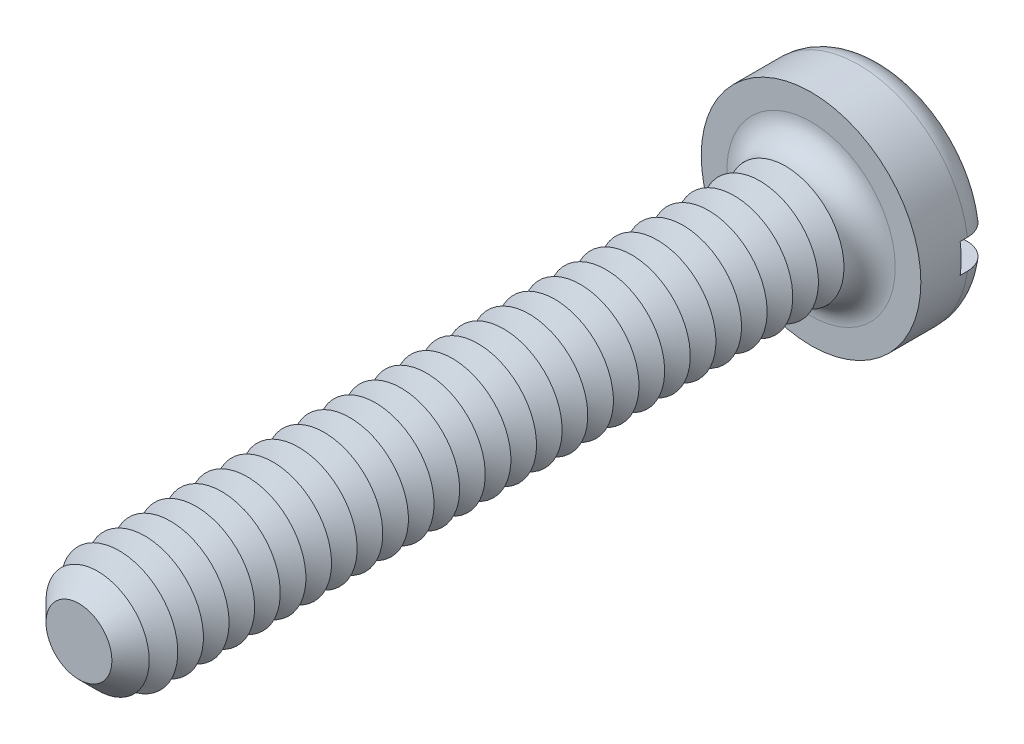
ISO-10303-21;
HEADER;
FILE_DESCRIPTION(('STEP AP214'),'2;1');
FILE_NAME('part.step','',(''),(''),'','','');
FILE_SCHEMA(('AUTOMOTIVE_DESIGN { 1 0 10303 214 1 1 1 1 }'));
ENDSEC;
DATA;
#1=APPLICATION_CONTEXT('core data for automotive mechanical design processes');
#2=APPLICATION_PROTOCOL_DEFINITION('international standard','automotive_design',2000,#1);
#3=PRODUCT_CONTEXT('',#1,'mechanical');
#4=PRODUCT('Part','Part','',(#3));
#5=PRODUCT_RELATED_PRODUCT_CATEGORY('part','',(#4));
#6=PRODUCT_DEFINITION_FORMATION('','',#4);
#7=PRODUCT_DEFINITION_CONTEXT('part definition',#1,'design');
#8=PRODUCT_DEFINITION('design','',#6,#7);
#9=PRODUCT_DEFINITION_SHAPE('','',#8);
#10=(LENGTH_UNIT() NAMED_UNIT(*) SI_UNIT(.MILLI.,.METRE.));
#11=(NAMED_UNIT(*) PLANE_ANGLE_UNIT() SI_UNIT($,.RADIAN.));
#12=(NAMED_UNIT(*) SI_UNIT($,.STERADIAN.) SOLID_ANGLE_UNIT());
#13=UNCERTAINTY_MEASURE_WITH_UNIT(LENGTH_MEASURE(1.E-05),#10,'distance_accuracy_value','');
#14=(GEOMETRIC_REPRESENTATION_CONTEXT(3) GLOBAL_UNCERTAINTY_ASSIGNED_CONTEXT((#13)) GLOBAL_UNIT_ASSIGNED_CONTEXT((#10,
#11,#12)) REPRESENTATION_CONTEXT('',''));
#15=CARTESIAN_POINT('',(0.,0.,0.));
#16=DIRECTION('',(0.,0.,1.));
#17=DIRECTION('',(1.,0.,0.));
#18=AXIS2_PLACEMENT_3D('',#15,#16,#17);
#19=CARTESIAN_POINT('',(0.,0.,-1.));
#20=DIRECTION('',(0.,0.,1.));
#21=DIRECTION('',(1.,0.,0.));
#22=AXIS2_PLACEMENT_3D('',#19,#20,#21);
#23=PLANE('',#22);
#24=CARTESIAN_POINT('',(0.,0.,-1.));
#25=DIRECTION('',(0.,0.,1.));
#26=DIRECTION('',(1.,0.,0.));
#27=AXIS2_PLACEMENT_3D('',#24,#25,#26);
#28=CIRCLE('',#27,1.15);
#29=CARTESIAN_POINT('',(-1.13247516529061,0.2,-1.));
#30=VERTEX_POINT('',#29);
#31=CARTESIAN_POINT('',(1.13247516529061,0.2,-1.));
#32=VERTEX_POINT('',#31);
#33=EDGE_CURVE('E116',#30,#32,#28,.F.);
#34=ORIENTED_EDGE('',*,*,#33,.T.);
#35=DIRECTION('',(1.,0.,0.));
#36=VECTOR('',#35,1.);
#37=CARTESIAN_POINT('',(-1.5,0.2,-1.));
#38=LINE('',#37,#36);
#39=EDGE_CURVE('E111',#30,#32,#38,.T.);
#40=ORIENTED_EDGE('',*,*,#39,.F.);
#41=EDGE_LOOP('',(#34,#40));
#42=FACE_BOUND('',#41,.T.);
#43=ADVANCED_FACE('F39',(#42),#23,.F.);
#44=CARTESIAN_POINT('',(0.,0.,-0.65));
#45=DIRECTION('',(0.,0.,1.));
#46=DIRECTION('',(1.,0.,0.));
#47=AXIS2_PLACEMENT_3D('',#44,#45,#46);
#48=TOROIDAL_SURFACE('',#47,1.15,0.35);
#49=CARTESIAN_POINT('',(-1.38697162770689,0.2,-0.89359719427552));
#50=CARTESIAN_POINT('',(-1.37305556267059,0.2,-0.907805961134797));
#51=CARTESIAN_POINT('',(-1.35791811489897,0.2,-0.9208403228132));
#52=CARTESIAN_POINT('',(-1.32565069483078,0.2,-0.944183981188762));
#53=CARTESIAN_POINT('',(-1.3085180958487,0.2,-0.954489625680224));
#54=CARTESIAN_POINT('',(-1.27278567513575,0.2,-0.972077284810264));
#55=CARTESIAN_POINT('',(-1.25418732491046,0.2,-0.979362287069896));
#56=CARTESIAN_POINT('',(-1.21604452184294,0.2,-0.990735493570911));
#57=CARTESIAN_POINT('',(-1.19650030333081,0.2,-0.994824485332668));
#58=CARTESIAN_POINT('',(-1.15682398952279,0.2,-0.99973845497));
#59=CARTESIAN_POINT('',(-1.1366881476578,0.2,-1.00053316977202));
#60=CARTESIAN_POINT('',(-1.09656272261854,0.2,-0.998770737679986));
#61=CARTESIAN_POINT('',(-1.07657315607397,0.2,-0.996213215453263));
#62=CARTESIAN_POINT('',(-1.03707277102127,0.2,-0.987780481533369));
#63=CARTESIAN_POINT('',(-1.01756977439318,0.2,-0.981868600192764));
#64=CARTESIAN_POINT('',(-0.979825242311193,0.2,-0.966867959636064));
#65=CARTESIAN_POINT('',(-0.961583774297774,0.2,-0.957779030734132));
#66=CARTESIAN_POINT('',(-0.926815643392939,0.2,-0.936628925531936));
#67=CARTESIAN_POINT('',(-0.910295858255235,0.2,-0.924556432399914));
#68=CARTESIAN_POINT('',(-0.879544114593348,0.2,-0.897781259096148));
#69=CARTESIAN_POINT('',(-0.8653120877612,0.2,-0.883078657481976));
#70=CARTESIAN_POINT('',(-0.83972745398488,0.2,-0.851619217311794));
#71=CARTESIAN_POINT('',(-0.8283448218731,0.2,-0.834886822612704));
#72=CARTESIAN_POINT('',(-0.80863848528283,0.2,-0.799707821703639));
#73=CARTESIAN_POINT('',(-0.80031425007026,0.2,-0.781261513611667));
#74=CARTESIAN_POINT('',(-0.787199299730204,0.2,-0.743695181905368));
#75=CARTESIAN_POINT('',(-0.782321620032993,0.2,-0.724605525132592));
#76=CARTESIAN_POINT('',(-0.775930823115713,0.2,-0.685871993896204));
#77=CARTESIAN_POINT('',(-0.774417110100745,0.2,-0.666228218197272));
#78=CARTESIAN_POINT('',(-0.774805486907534,0.2,-0.627456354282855));
#79=CARTESIAN_POINT('',(-0.776625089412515,0.2,-0.608327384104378));
#80=CARTESIAN_POINT('',(-0.783452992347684,0.2,-0.570648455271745));
#81=CARTESIAN_POINT('',(-0.788461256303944,0.2,-0.552098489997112));
#82=CARTESIAN_POINT('',(-0.801489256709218,0.2,-0.516098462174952));
#83=CARTESIAN_POINT('',(-0.809507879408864,0.2,-0.49864799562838));
#84=CARTESIAN_POINT('',(-0.828295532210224,0.2,-0.465297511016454));
#85=CARTESIAN_POINT('',(-0.839064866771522,0.2,-0.449397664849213));
#86=CARTESIAN_POINT('',(-0.863311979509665,0.2,-0.419196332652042));
#87=CARTESIAN_POINT('',(-0.876847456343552,0.2,-0.404941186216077));
#88=CARTESIAN_POINT('',(-0.906064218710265,0.2,-0.378832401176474));
#89=CARTESIAN_POINT('',(-0.921745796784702,0.2,-0.366979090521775));
#90=CARTESIAN_POINT('',(-0.955261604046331,0.2,-0.345690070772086));
#91=CARTESIAN_POINT('',(-0.973141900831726,0.2,-0.336326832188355));
#92=CARTESIAN_POINT('',(-1.01020647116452,0.2,-0.320690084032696));
#93=CARTESIAN_POINT('',(-1.02939085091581,0.2,-0.314416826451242));
#94=CARTESIAN_POINT('',(-1.06878849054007,0.2,-0.305073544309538));
#95=CARTESIAN_POINT('',(-1.0890118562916,0.2,-0.302046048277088));
#96=CARTESIAN_POINT('',(-1.12968032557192,0.2,-0.299436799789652));
#97=CARTESIAN_POINT('',(-1.15012542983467,0.2,-0.299855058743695));
#98=CARTESIAN_POINT('',(-1.1906059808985,0.2,-0.304138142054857));
#99=CARTESIAN_POINT('',(-1.21064224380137,0.2,-0.307995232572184));
#100=CARTESIAN_POINT('',(-1.24976957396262,0.2,-0.319055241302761));
#101=CARTESIAN_POINT('',(-1.26886068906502,0.2,-0.326257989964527));
#102=CARTESIAN_POINT('',(-1.30533597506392,0.2,-0.343725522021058));
#103=CARTESIAN_POINT('',(-1.32273620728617,0.2,-0.353956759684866));
#104=CARTESIAN_POINT('',(-1.35554323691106,0.2,-0.377229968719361));
#105=CARTESIAN_POINT('',(-1.37095016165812,0.2,-0.390271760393));
#106=CARTESIAN_POINT('',(-1.39913145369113,0.2,-0.418621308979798));
#107=CARTESIAN_POINT('',(-1.41193602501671,0.2,-0.43389904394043));
#108=CARTESIAN_POINT('',(-1.43476712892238,0.2,-0.46640589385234));
#109=CARTESIAN_POINT('',(-1.44479381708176,0.2,-0.483634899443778));
#110=CARTESIAN_POINT('',(-1.4616814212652,0.2,-0.519367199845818));
#111=CARTESIAN_POINT('',(-1.46857323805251,0.2,-0.537855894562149));
#112=CARTESIAN_POINT('',(-1.4791331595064,0.2,-0.575731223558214));
#113=CARTESIAN_POINT('',(-1.48280152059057,0.2,-0.595117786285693));
#114=CARTESIAN_POINT('',(-1.4867930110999,0.2,-0.634109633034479));
#115=CARTESIAN_POINT('',(-1.48713684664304,0.2,-0.653712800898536));
#116=CARTESIAN_POINT('',(-1.48452244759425,0.2,-0.692702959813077));
#117=CARTESIAN_POINT('',(-1.48156342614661,0.2,-0.712089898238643));
#118=CARTESIAN_POINT('',(-1.47243636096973,0.2,-0.75006822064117));
#119=CARTESIAN_POINT('',(-1.46627182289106,0.2,-0.768660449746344));
#120=CARTESIAN_POINT('',(-1.45092056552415,0.2,-0.804533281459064));
#121=CARTESIAN_POINT('',(-1.44173755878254,0.2,-0.821815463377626));
#122=CARTESIAN_POINT('',(-1.42477940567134,0.2,-0.848152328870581));
#123=CARTESIAN_POINT('',(-1.41786672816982,0.2,-0.857773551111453));
#124=CARTESIAN_POINT('',(-1.40310412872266,0.2,-0.876267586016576));
#125=CARTESIAN_POINT('',(-1.39525421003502,0.2,-0.885140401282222));
#126=CARTESIAN_POINT('',(-1.38697162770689,0.2,-0.89359719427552));
#127=B_SPLINE_CURVE_WITH_KNOTS('',3,(#49,#50,#51,#52,#53,#54,#55,#56,#57,#58,#59,#60,#61,#62,
#63,#64,#65,#66,#67,#68,#69,#70,#71,#72,#73,#74,#75,#76,#77,#78,#79,#80,#81,#82,#83,#84,#85,#86,
#87,#88,#89,#90,#91,#92,#93,#94,#95,#96,#97,#98,#99,#100,#101,#102,#103,#104,#105,#106,#107,
#108,#109,#110,#111,#112,#113,#114,#115,#116,#117,#118,#119,#120,#121,#122,#123,#124,#125,#126),
.UNSPECIFIED.,.T.,.F.,(4,2,2,2,2,2,2,2,2,2,2,2,2,2,2,2,2,2,2,2,2,2,2,2,2,2,2,2,2,2,2,2,2,2,2,2,
2,2,4),(0.,0.0596211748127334,0.119321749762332,0.178963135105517,0.238589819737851,
0.298763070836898,0.358943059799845,0.419793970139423,0.48064813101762,0.541736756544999,
0.602823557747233,0.663236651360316,0.72363925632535,0.782457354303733,0.841265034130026,
0.898637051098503,0.956008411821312,1.01335856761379,1.07071507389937,1.12941939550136,
1.18813172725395,1.24840147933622,1.30867614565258,1.36973127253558,1.43078660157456,
1.49170496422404,1.55262023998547,1.61288453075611,1.67314496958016,1.73266007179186,
1.792171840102,1.85108355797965,1.90999058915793,1.96853049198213,2.02708434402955,
2.08557429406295,2.14399257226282,2.17947810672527,2.21496351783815),.UNSPECIFIED.);
#128=CARTESIAN_POINT('',(-1.48660687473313,0.2,-0.649999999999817));
#129=VERTEX_POINT('',#128);
#130=EDGE_CURVE('E401',#129,#30,#127,.T.);
#131=ORIENTED_EDGE('',*,*,#130,.F.);
#132=CARTESIAN_POINT('',(0.,0.,-0.65));
#133=DIRECTION('',(0.,0.,1.));
#134=DIRECTION('',(1.,0.,0.));
#135=AXIS2_PLACEMENT_3D('',#132,#133,#134);
#136=CIRCLE('',#135,1.5);
#137=CARTESIAN_POINT('',(1.48660687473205,0.2,-0.649999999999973));
#138=VERTEX_POINT('',#137);
#139=EDGE_CURVE('E125',#138,#129,#136,.T.);
#140=ORIENTED_EDGE('',*,*,#139,.F.);
#141=CARTESIAN_POINT('',(0.780520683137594,0.2,-0.713112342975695));
#142=CARTESIAN_POINT('',(0.784146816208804,0.2,-0.73226748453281));
#143=CARTESIAN_POINT('',(0.789425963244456,0.2,-0.751125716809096));
#144=CARTESIAN_POINT('',(0.803106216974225,0.2,-0.78769198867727));
#145=CARTESIAN_POINT('',(0.811511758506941,0.2,-0.805398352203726));
#146=CARTESIAN_POINT('',(0.831144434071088,0.2,-0.839131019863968));
#147=CARTESIAN_POINT('',(0.842366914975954,0.2,-0.855160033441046));
#148=CARTESIAN_POINT('',(0.867288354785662,0.2,-0.88515062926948));
#149=CARTESIAN_POINT('',(0.880986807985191,0.2,-0.899112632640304));
#150=CARTESIAN_POINT('',(0.910770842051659,0.2,-0.924888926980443));
#151=CARTESIAN_POINT('',(0.926899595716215,0.2,-0.936653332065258));
#152=CARTESIAN_POINT('',(0.960871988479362,0.2,-0.957372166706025));
#153=CARTESIAN_POINT('',(0.978715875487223,0.2,-0.966326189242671));
#154=CARTESIAN_POINT('',(1.01600338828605,0.2,-0.981340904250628));
#155=CARTESIAN_POINT('',(1.03547204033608,0.2,-0.987339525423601));
#156=CARTESIAN_POINT('',(1.07513874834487,0.2,-0.995998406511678));
#157=CARTESIAN_POINT('',(1.09533683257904,0.2,-0.998658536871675));
#158=CARTESIAN_POINT('',(1.1359751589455,0.2,-1.0005575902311));
#159=CARTESIAN_POINT('',(1.1564160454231,0.2,-0.99978283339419));
#160=CARTESIAN_POINT('',(1.19687229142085,0.2,-0.994784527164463));
#161=CARTESIAN_POINT('',(1.21688766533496,0.2,-0.990561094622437));
#162=CARTESIAN_POINT('',(1.25575385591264,0.2,-0.978813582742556));
#163=CARTESIAN_POINT('',(1.27461259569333,0.2,-0.971315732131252));
#164=CARTESIAN_POINT('',(1.31078063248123,0.2,-0.953221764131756));
#165=CARTESIAN_POINT('',(1.32809002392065,0.2,-0.942625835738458));
#166=CARTESIAN_POINT('',(1.36044102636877,0.2,-0.918776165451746));
#167=CARTESIAN_POINT('',(1.37550786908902,0.2,-0.905556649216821));
#168=CARTESIAN_POINT('',(1.40317627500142,0.2,-0.876749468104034));
#169=CARTESIAN_POINT('',(1.41577799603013,0.2,-0.861161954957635));
#170=CARTESIAN_POINT('',(1.43800830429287,0.2,-0.828254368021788));
#171=CARTESIAN_POINT('',(1.44766923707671,0.2,-0.810956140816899));
#172=CARTESIAN_POINT('',(1.46392269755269,0.2,-0.774973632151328));
#173=CARTESIAN_POINT('',(1.4705153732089,0.2,-0.756289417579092));
#174=CARTESIAN_POINT('',(1.48039453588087,0.2,-0.718226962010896));
#175=CARTESIAN_POINT('',(1.48370713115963,0.2,-0.69885549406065));
#176=CARTESIAN_POINT('',(1.48701993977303,0.2,-0.659831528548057));
#177=CARTESIAN_POINT('',(1.4870202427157,0.2,-0.640179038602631));
#178=CARTESIAN_POINT('',(1.48371470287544,0.2,-0.6012267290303));
#179=CARTESIAN_POINT('',(1.48042091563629,0.2,-0.581925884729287));
#180=CARTESIAN_POINT('',(1.47064268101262,0.2,-0.544150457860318));
#181=CARTESIAN_POINT('',(1.46415824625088,0.2,-0.525675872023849));
#182=CARTESIAN_POINT('',(1.4481813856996,0.2,-0.490055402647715));
#183=CARTESIAN_POINT('',(1.43868601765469,0.2,-0.472910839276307));
#184=CARTESIAN_POINT('',(1.41696658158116,0.2,-0.440447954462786));
#185=CARTESIAN_POINT('',(1.40474246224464,0.2,-0.425129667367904));
#186=CARTESIAN_POINT('',(1.37784446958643,0.2,-0.39666049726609));
#187=CARTESIAN_POINT('',(1.36315749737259,0.2,-0.383521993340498));
#188=CARTESIAN_POINT('',(1.33180407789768,0.2,-0.359869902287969));
#189=CARTESIAN_POINT('',(1.31513754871,0.2,-0.349356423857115));
#190=CARTESIAN_POINT('',(1.28013085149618,0.2,-0.331143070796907));
#191=CARTESIAN_POINT('',(1.26177629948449,0.2,-0.323470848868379));
#192=CARTESIAN_POINT('',(1.224049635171,0.2,-0.311275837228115));
#193=CARTESIAN_POINT('',(1.20467746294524,0.2,-0.306753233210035));
#194=CARTESIAN_POINT('',(1.1652160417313,0.2,-0.300927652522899));
#195=CARTESIAN_POINT('',(1.14512096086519,0.2,-0.299664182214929));
#196=CARTESIAN_POINT('',(1.10499953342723,0.2,-0.300488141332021));
#197=CARTESIAN_POINT('',(1.08497319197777,0.2,-0.302575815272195));
#198=CARTESIAN_POINT('',(1.04531606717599,0.2,-0.310075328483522));
#199=CARTESIAN_POINT('',(1.0256923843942,0.2,-0.315524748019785));
#200=CARTESIAN_POINT('',(0.987629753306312,0.2,-0.329624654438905));
#201=CARTESIAN_POINT('',(0.96919087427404,0.2,-0.338275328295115));
#202=CARTESIAN_POINT('',(0.933939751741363,0.2,-0.358590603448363));
#203=CARTESIAN_POINT('',(0.917135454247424,0.2,-0.370269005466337));
#204=CARTESIAN_POINT('',(0.88574931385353,0.2,-0.396306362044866));
#205=CARTESIAN_POINT('',(0.87116734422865,0.2,-0.410665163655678));
#206=CARTESIAN_POINT('',(0.844813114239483,0.2,-0.441518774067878));
#207=CARTESIAN_POINT('',(0.833014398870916,0.2,-0.457990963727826));
#208=CARTESIAN_POINT('',(0.812431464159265,0.2,-0.492729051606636));
#209=CARTESIAN_POINT('',(0.803647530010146,0.2,-0.510995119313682));
#210=CARTESIAN_POINT('',(0.789590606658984,0.2,-0.548308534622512));
#211=CARTESIAN_POINT('',(0.784235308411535,0.2,-0.5673249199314));
#212=CARTESIAN_POINT('',(0.7768953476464,0.2,-0.605979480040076));
#213=CARTESIAN_POINT('',(0.774905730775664,0.2,-0.625616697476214));
#214=CARTESIAN_POINT('',(0.774470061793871,0.2,-0.656633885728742));
#215=CARTESIAN_POINT('',(0.7748847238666,0.2,-0.668009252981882));
#216=CARTESIAN_POINT('',(0.776852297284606,0.2,-0.690660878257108));
#217=CARTESIAN_POINT('',(0.77840517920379,0.2,-0.701937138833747));
#218=CARTESIAN_POINT('',(0.780520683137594,0.2,-0.713112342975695));
#219=B_SPLINE_CURVE_WITH_KNOTS('',3,(#141,#142,#143,#144,#145,#146,#147,#148,#149,#150,#151,
#152,#153,#154,#155,#156,#157,#158,#159,#160,#161,#162,#163,#164,#165,#166,#167,#168,#169,#170,
#171,#172,#173,#174,#175,#176,#177,#178,#179,#180,#181,#182,#183,#184,#185,#186,#187,#188,#189,
#190,#191,#192,#193,#194,#195,#196,#197,#198,#199,#200,#201,#202,#203,#204,#205,#206,#207,#208,
#209,#210,#211,#212,#213,#214,#215,#216,#217,#218),.UNSPECIFIED.,.T.,.F.,(4,2,2,2,2,2,2,2,2,2,2,
2,2,2,2,2,2,2,2,2,2,2,2,2,2,2,2,2,2,2,2,2,2,2,2,2,2,2,4),(0.,0.0584431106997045,
0.11696944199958,0.175399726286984,0.233818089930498,0.293433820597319,0.353058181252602,
0.413886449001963,0.474717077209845,0.53579018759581,0.596861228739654,0.65745180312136,
0.718038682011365,0.777881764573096,0.837721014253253,0.896876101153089,0.95602833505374,
1.01470585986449,1.07338179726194,1.13184377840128,1.19030552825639,1.24882458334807,
1.30734473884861,1.36618662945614,1.42503095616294,1.48443380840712,1.54384016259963,
1.60396331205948,1.66409084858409,1.72490303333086,1.78571877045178,1.84681674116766,
1.90791122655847,1.96839922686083,2.02889294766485,2.08787382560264,2.14676780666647,
2.18086468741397,2.21496068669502),.UNSPECIFIED.);
#220=EDGE_CURVE('E403',#32,#138,#219,.T.);
#221=ORIENTED_EDGE('',*,*,#220,.F.);
#222=ORIENTED_EDGE('',*,*,#33,.F.);
#223=EDGE_LOOP('',(#131,#140,#221,#222));
#224=FACE_BOUND('',#223,.T.);
#225=ADVANCED_FACE('F385',(#224),#48,.T.);
#226=CARTESIAN_POINT('',(0.,0.,-1.));
#227=DIRECTION('',(0.,0.,1.));
#228=DIRECTION('',(1.,0.,0.));
#229=AXIS2_PLACEMENT_3D('',#226,#227,#228);
#230=CYLINDRICAL_SURFACE('',#229,1.5);
#231=DIRECTION('',(0.,0.,1.));
#232=VECTOR('',#231,1.);
#233=CARTESIAN_POINT('',(1.48660687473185,0.2,-1.));
#234=LINE('',#233,#232);
#235=CARTESIAN_POINT('',(1.48660687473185,0.2,-0.55));
#236=VERTEX_POINT('',#235);
#237=EDGE_CURVE('E417',#138,#236,#234,.T.);
#238=ORIENTED_EDGE('',*,*,#237,.F.);
#239=ORIENTED_EDGE('',*,*,#139,.T.);
#240=DIRECTION('',(0.,0.,1.));
#241=VECTOR('',#240,1.);
#242=CARTESIAN_POINT('',(-1.48660687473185,0.2,-1.));
#243=LINE('',#242,#241);
#244=CARTESIAN_POINT('',(-1.48660687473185,0.2,-0.55));
#245=VERTEX_POINT('',#244);
#246=EDGE_CURVE('E63',#245,#129,#243,.F.);
#247=ORIENTED_EDGE('',*,*,#246,.F.);
#248=CARTESIAN_POINT('',(0.,0.,-0.55));
#249=DIRECTION('',(0.,0.,-1.));
#250=DIRECTION('',(-1.,0.,0.));
#251=AXIS2_PLACEMENT_3D('',#248,#249,#250);
#252=CIRCLE('',#251,1.5);
#253=CARTESIAN_POINT('',(-1.48660687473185,-0.2,-0.55));
#254=VERTEX_POINT('',#253);
#255=EDGE_CURVE('E43',#245,#254,#252,.F.);
#256=ORIENTED_EDGE('',*,*,#255,.T.);
#257=DIRECTION('',(0.,0.,1.));
#258=VECTOR('',#257,1.);
#259=CARTESIAN_POINT('',(-1.48660687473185,-0.2,-1.));
#260=LINE('',#259,#258);
#261=CARTESIAN_POINT('',(-1.48660687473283,-0.2,-0.650000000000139));
#262=VERTEX_POINT('',#261);
#263=EDGE_CURVE('E415',#262,#254,#260,.T.);
#264=ORIENTED_EDGE('',*,*,#263,.F.);
#265=CARTESIAN_POINT('',(1.48660687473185,-0.2,-0.65));
#266=VERTEX_POINT('',#265);
#267=EDGE_CURVE('E127',#262,#266,#136,.T.);
#268=ORIENTED_EDGE('',*,*,#267,.T.);
#269=DIRECTION('',(0.,0.,1.));
#270=VECTOR('',#269,1.);
#271=CARTESIAN_POINT('',(1.48660687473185,-0.2,-1.));
#272=LINE('',#271,#270);
#273=CARTESIAN_POINT('',(1.48660687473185,-0.2,-0.55));
#274=VERTEX_POINT('',#273);
#275=EDGE_CURVE('E55',#274,#266,#272,.F.);
#276=ORIENTED_EDGE('',*,*,#275,.F.);
#277=EDGE_CURVE('E11',#274,#236,#252,.F.);
#278=ORIENTED_EDGE('',*,*,#277,.T.);
#279=EDGE_LOOP('',(#238,#239,#247,#256,#264,#268,#276,#278));
#280=FACE_BOUND('',#279,.T.);
#281=CARTESIAN_POINT('',(0.,0.,0.));
#282=DIRECTION('',(0.,0.,1.));
#283=DIRECTION('',(1.,0.,0.));
#284=AXIS2_PLACEMENT_3D('',#281,#282,#283);
#285=CIRCLE('',#284,1.5);
#286=CARTESIAN_POINT('',(1.5,0.,0.));
#287=VERTEX_POINT('',#286);
#288=EDGE_CURVE('E420',#287,#287,#285,.T.);
#289=ORIENTED_EDGE('',*,*,#288,.F.);
#290=EDGE_LOOP('',(#289));
#291=FACE_BOUND('',#290,.T.);
#292=ADVANCED_FACE('F381',(#280,#291),#230,.T.);
#293=CARTESIAN_POINT('',(1.13247516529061,-0.2,-1.));
#294=VERTEX_POINT('',#293);
#295=CARTESIAN_POINT('',(-1.13247516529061,-0.2,-1.));
#296=VERTEX_POINT('',#295);
#297=EDGE_CURVE('E109',#294,#296,#28,.F.);
#298=ORIENTED_EDGE('',*,*,#297,.T.);
#299=DIRECTION('',(-1.,0.,0.));
#300=VECTOR('',#299,1.);
#301=CARTESIAN_POINT('',(-1.5,-0.2,-1.));
#302=LINE('',#301,#300);
#303=EDGE_CURVE('E96',#294,#296,#302,.T.);
#304=ORIENTED_EDGE('',*,*,#303,.F.);
#305=EDGE_LOOP('',(#298,#304));
#306=FACE_BOUND('',#305,.T.);
#307=ADVANCED_FACE('F108',(#306),#23,.F.);
#308=CARTESIAN_POINT('',(0.,0.,0.));
#309=DIRECTION('',(0.,0.,1.));
#310=DIRECTION('',(1.,0.,0.));
#311=AXIS2_PLACEMENT_3D('',#308,#309,#310);
#312=PLANE('',#311);
#313=CARTESIAN_POINT('',(0.,0.,0.));
#314=DIRECTION('',(0.,0.,1.));
#315=DIRECTION('',(1.,0.,0.));
#316=AXIS2_PLACEMENT_3D('',#313,#314,#315);
#317=CIRCLE('',#316,1.15);
#318=CARTESIAN_POINT('',(1.15,0.,0.));
#319=VERTEX_POINT('',#318);
#320=EDGE_CURVE('E115',#319,#319,#317,.F.);
#321=ORIENTED_EDGE('',*,*,#320,.T.);
#322=EDGE_LOOP('',(#321));
#323=FACE_BOUND('',#322,.T.);
#324=ORIENTED_EDGE('',*,*,#288,.T.);
#325=EDGE_LOOP('',(#324));
#326=FACE_BOUND('',#325,.T.);
#327=ADVANCED_FACE('F380',(#323,#326),#312,.T.);
#328=CARTESIAN_POINT('',(-1.38697162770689,-0.2,-0.89359719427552));
#329=CARTESIAN_POINT('',(-1.40068341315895,-0.2,-0.87959447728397));
#330=CARTESIAN_POINT('',(-1.41322919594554,-0.2,-0.864431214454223));
#331=CARTESIAN_POINT('',(-1.43561095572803,-0.2,-0.83220389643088));
#332=CARTESIAN_POINT('',(-1.44544396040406,-0.2,-0.815137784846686));
#333=CARTESIAN_POINT('',(-1.46209732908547,-0.2,-0.779595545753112));
#334=CARTESIAN_POINT('',(-1.46891825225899,-0.2,-0.761119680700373));
#335=CARTESIAN_POINT('',(-1.479344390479,-0.2,-0.723286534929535));
#336=CARTESIAN_POINT('',(-1.48295036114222,-0.2,-0.703929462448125));
#337=CARTESIAN_POINT('',(-1.48683413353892,-0.2,-0.6649653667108));
#338=CARTESIAN_POINT('',(-1.48712565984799,-0.2,-0.645359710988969));
#339=CARTESIAN_POINT('',(-1.48440736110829,-0.2,-0.606378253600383));
#340=CARTESIAN_POINT('',(-1.48139747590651,-0.2,-0.587002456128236));
#341=CARTESIAN_POINT('',(-1.47217267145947,-0.2,-0.549061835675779));
#342=CARTESIAN_POINT('',(-1.46596274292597,-0.2,-0.530495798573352));
#343=CARTESIAN_POINT('',(-1.45052327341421,-0.2,-0.494665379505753));
#344=CARTESIAN_POINT('',(-1.44129371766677,-0.2,-0.477401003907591));
#345=CARTESIAN_POINT('',(-1.42005139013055,-0.2,-0.444603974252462));
#346=CARTESIAN_POINT('',(-1.40803014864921,-0.2,-0.429076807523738));
#347=CARTESIAN_POINT('',(-1.38156905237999,-0.2,-0.400242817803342));
#348=CARTESIAN_POINT('',(-1.36712913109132,-0.2,-0.386936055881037));
#349=CARTESIAN_POINT('',(-1.33612890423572,-0.2,-0.362811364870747));
#350=CARTESIAN_POINT('',(-1.31955365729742,-0.2,-0.352012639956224));
#351=CARTESIAN_POINT('',(-1.28484098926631,-0.2,-0.333316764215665));
#352=CARTESIAN_POINT('',(-1.26670348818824,-0.2,-0.325419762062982));
#353=CARTESIAN_POINT('',(-1.22917040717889,-0.2,-0.31265726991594));
#354=CARTESIAN_POINT('',(-1.20976324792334,-0.2,-0.3078258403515));
#355=CARTESIAN_POINT('',(-1.17041685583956,-0.2,-0.30144641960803));
#356=CARTESIAN_POINT('',(-1.15047758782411,-0.2,-0.299898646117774));
#357=CARTESIAN_POINT('',(-1.11037109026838,-0.2,-0.300112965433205));
#358=CARTESIAN_POINT('',(-1.09020407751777,-0.2,-0.301916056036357));
#359=CARTESIAN_POINT('',(-1.05044996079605,-0.2,-0.308849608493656));
#360=CARTESIAN_POINT('',(-1.03086289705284,-0.2,-0.313980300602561));
#361=CARTESIAN_POINT('',(-0.992636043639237,-0.2,-0.327485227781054));
#362=CARTESIAN_POINT('',(-0.974006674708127,-0.2,-0.335888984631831));
#363=CARTESIAN_POINT('',(-0.938423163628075,-0.2,-0.355707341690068));
#364=CARTESIAN_POINT('',(-0.921469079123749,-0.2,-0.367122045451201));
#365=CARTESIAN_POINT('',(-0.889752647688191,-0.2,-0.392642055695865));
#366=CARTESIAN_POINT('',(-0.874987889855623,-0.2,-0.406744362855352));
#367=CARTESIAN_POINT('',(-0.848085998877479,-0.2,-0.437266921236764));
#368=CARTESIAN_POINT('',(-0.835948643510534,-0.2,-0.453686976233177));
#369=CARTESIAN_POINT('',(-0.814894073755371,-0.2,-0.488078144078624));
#370=CARTESIAN_POINT('',(-0.805923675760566,-0.2,-0.506016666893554));
#371=CARTESIAN_POINT('',(-0.791223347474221,-0.2,-0.543175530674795));
#372=CARTESIAN_POINT('',(-0.78549275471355,-0.2,-0.562395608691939));
#373=CARTESIAN_POINT('',(-0.777599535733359,-0.2,-0.600984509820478));
#374=CARTESIAN_POINT('',(-0.775340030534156,-0.2,-0.62033354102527));
#375=CARTESIAN_POINT('',(-0.774164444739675,-0.2,-0.659131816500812));
#376=CARTESIAN_POINT('',(-0.775247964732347,-0.2,-0.678581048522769));
#377=CARTESIAN_POINT('',(-0.78067015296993,-0.2,-0.716679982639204));
#378=CARTESIAN_POINT('',(-0.784953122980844,-0.2,-0.735337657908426));
#379=CARTESIAN_POINT('',(-0.796558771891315,-0.2,-0.771681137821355));
#380=CARTESIAN_POINT('',(-0.803881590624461,-0.2,-0.789366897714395));
#381=CARTESIAN_POINT('',(-0.821417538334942,-0.2,-0.823475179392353));
#382=CARTESIAN_POINT('',(-0.831660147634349,-0.2,-0.839882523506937));
#383=CARTESIAN_POINT('',(-0.854684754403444,-0.2,-0.870805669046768));
#384=CARTESIAN_POINT('',(-0.867467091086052,-0.2,-0.885321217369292));
#385=CARTESIAN_POINT('',(-0.895584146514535,-0.2,-0.912470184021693));
#386=CARTESIAN_POINT('',(-0.910979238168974,-0.2,-0.925041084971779));
#387=CARTESIAN_POINT('',(-0.943622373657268,-0.2,-0.947488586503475));
#388=CARTESIAN_POINT('',(-0.960870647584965,-0.2,-0.957364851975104));
#389=CARTESIAN_POINT('',(-0.997151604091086,-0.2,-0.974359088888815));
#390=CARTESIAN_POINT('',(-1.01621564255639,-0.2,-0.98141019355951));
#391=CARTESIAN_POINT('',(-1.05525219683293,-0.2,-0.992235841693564));
#392=CARTESIAN_POINT('',(-1.07522472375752,-0.2,-0.996010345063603));
#393=CARTESIAN_POINT('',(-1.11565152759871,-0.2,-1.00018247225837));
#394=CARTESIAN_POINT('',(-1.1361080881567,-0.2,-1.00055804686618));
#395=CARTESIAN_POINT('',(-1.17679659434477,-0.2,-0.997846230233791));
#396=CARTESIAN_POINT('',(-1.19702848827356,-0.2,-0.994758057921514));
#397=CARTESIAN_POINT('',(-1.23655375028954,-0.2,-0.985216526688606));
#398=CARTESIAN_POINT('',(-1.25585198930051,-0.2,-0.978783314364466));
#399=CARTESIAN_POINT('',(-1.29305658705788,-0.2,-0.962732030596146));
#400=CARTESIAN_POINT('',(-1.31096467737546,-0.2,-0.953118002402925));
#401=CARTESIAN_POINT('',(-1.33859353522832,-0.2,-0.935076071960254));
#402=CARTESIAN_POINT('',(-1.34889525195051,-0.2,-0.927521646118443));
#403=CARTESIAN_POINT('',(-1.36861998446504,-0.2,-0.911341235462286));
#404=CARTESIAN_POINT('',(-1.37804300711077,-0.2,-0.90271525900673));
#405=CARTESIAN_POINT('',(-1.38697162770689,-0.2,-0.89359719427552));
#406=B_SPLINE_CURVE_WITH_KNOTS('',3,(#328,#329,#330,#331,#332,#333,#334,#335,#336,#337,#338,
#339,#340,#341,#342,#343,#344,#345,#346,#347,#348,#349,#350,#351,#352,#353,#354,#355,#356,#357,
#358,#359,#360,#361,#362,#363,#364,#365,#366,#367,#368,#369,#370,#371,#372,#373,#374,#375,#376,
#377,#378,#379,#380,#381,#382,#383,#384,#385,#386,#387,#388,#389,#390,#391,#392,#393,#394,#395,
#396,#397,#398,#399,#400,#401,#402,#403,#404,#405),.UNSPECIFIED.,.T.,.F.,(4,2,2,2,2,2,2,2,2,2,2,
2,2,2,2,2,2,2,2,2,2,2,2,2,2,2,2,2,2,2,2,2,2,2,2,2,2,2,4),(0.,0.0587484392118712,
0.117560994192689,0.17636262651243,0.235150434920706,0.293694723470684,0.352240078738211,
0.410694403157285,0.46914901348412,0.527783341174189,0.586419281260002,0.645490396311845,
0.704564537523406,0.76428403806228,0.824007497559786,0.884466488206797,0.944929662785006,
1.00595131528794,1.06697506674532,1.12793111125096,1.18888199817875,1.2487542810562,
1.30861431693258,1.36677117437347,1.4249210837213,1.48208160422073,1.53924475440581,
1.59700685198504,1.65477666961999,1.71413044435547,1.77349159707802,1.83418476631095,
1.89487867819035,1.95596603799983,2.01706717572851,2.07780450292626,2.13846491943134,
2.17672008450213,2.21497495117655),.UNSPECIFIED.);
#407=EDGE_CURVE('E103',#296,#262,#406,.T.);
#408=ORIENTED_EDGE('',*,*,#407,.F.);
#409=ORIENTED_EDGE('',*,*,#297,.F.);
#410=CARTESIAN_POINT('',(0.780520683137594,-0.2,-0.713112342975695));
#411=CARTESIAN_POINT('',(0.776967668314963,-0.2,-0.694332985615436));
#412=CARTESIAN_POINT('',(0.774997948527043,-0.2,-0.675240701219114));
#413=CARTESIAN_POINT('',(0.774305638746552,-0.2,-0.636983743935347));
#414=CARTESIAN_POINT('',(0.775586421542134,-0.2,-0.617819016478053));
#415=CARTESIAN_POINT('',(0.781350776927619,-0.2,-0.579992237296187));
#416=CARTESIAN_POINT('',(0.78583187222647,-0.2,-0.56132980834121));
#417=CARTESIAN_POINT('',(0.797836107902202,-0.2,-0.525016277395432));
#418=CARTESIAN_POINT('',(0.805358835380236,-0.2,-0.507365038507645));
#419=CARTESIAN_POINT('',(0.823276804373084,-0.2,-0.47338978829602));
#420=CARTESIAN_POINT('',(0.833696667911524,-0.2,-0.457078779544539));
#421=CARTESIAN_POINT('',(0.857057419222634,-0.2,-0.426375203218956));
#422=CARTESIAN_POINT('',(0.869998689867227,-0.2,-0.411982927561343));
#423=CARTESIAN_POINT('',(0.898418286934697,-0.2,-0.38510575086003));
#424=CARTESIAN_POINT('',(0.913956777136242,-0.2,-0.372684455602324));
#425=CARTESIAN_POINT('',(0.946860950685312,-0.2,-0.350558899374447));
#426=CARTESIAN_POINT('',(0.964226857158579,-0.2,-0.340854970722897));
#427=CARTESIAN_POINT('',(1.00070854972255,-0.2,-0.324232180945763));
#428=CARTESIAN_POINT('',(1.01985442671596,-0.2,-0.317379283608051));
#429=CARTESIAN_POINT('',(1.0590214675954,-0.2,-0.306962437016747));
#430=CARTESIAN_POINT('',(1.07904267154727,-0.2,-0.303398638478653));
#431=CARTESIAN_POINT('',(1.11952320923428,-0.2,-0.299657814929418));
#432=CARTESIAN_POINT('',(1.13998446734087,-0.2,-0.299501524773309));
#433=CARTESIAN_POINT('',(1.1806395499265,-0.2,-0.302650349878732));
#434=CARTESIAN_POINT('',(1.20083338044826,-0.2,-0.305955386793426));
#435=CARTESIAN_POINT('',(1.24023260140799,-0.2,-0.315918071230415));
#436=CARTESIAN_POINT('',(1.25944372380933,-0.2,-0.322553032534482));
#437=CARTESIAN_POINT('',(1.29645854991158,-0.2,-0.338992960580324));
#438=CARTESIAN_POINT('',(1.31426233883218,-0.2,-0.348797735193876));
#439=CARTESIAN_POINT('',(1.34772734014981,-0.2,-0.371172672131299));
#440=CARTESIAN_POINT('',(1.36341179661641,-0.2,-0.383708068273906));
#441=CARTESIAN_POINT('',(1.39242189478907,-0.2,-0.41126267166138));
#442=CARTESIAN_POINT('',(1.40574768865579,-0.2,-0.426281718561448));
#443=CARTESIAN_POINT('',(1.42949833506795,-0.2,-0.458186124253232));
#444=CARTESIAN_POINT('',(1.43995542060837,-0.2,-0.475047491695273));
#445=CARTESIAN_POINT('',(1.45786189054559,-0.2,-0.510298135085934));
#446=CARTESIAN_POINT('',(1.46531142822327,-0.2,-0.528687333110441));
#447=CARTESIAN_POINT('',(1.47692889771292,-0.2,-0.566301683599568));
#448=CARTESIAN_POINT('',(1.48112438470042,-0.2,-0.585518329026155));
#449=CARTESIAN_POINT('',(1.48621428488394,-0.2,-0.624383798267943));
#450=CARTESIAN_POINT('',(1.48710879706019,-0.2,-0.644032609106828));
#451=CARTESIAN_POINT('',(1.48557356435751,-0.2,-0.683115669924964));
#452=CARTESIAN_POINT('',(1.48315796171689,-0.2,-0.702550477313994));
#453=CARTESIAN_POINT('',(1.47509909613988,-0.2,-0.740738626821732));
#454=CARTESIAN_POINT('',(1.46945585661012,-0.2,-0.759491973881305));
#455=CARTESIAN_POINT('',(1.45510530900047,-0.2,-0.79579446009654));
#456=CARTESIAN_POINT('',(1.44639690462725,-0.2,-0.813343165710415));
#457=CARTESIAN_POINT('',(1.42617120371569,-0.2,-0.846738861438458));
#458=CARTESIAN_POINT('',(1.41465386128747,-0.2,-0.862585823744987));
#459=CARTESIAN_POINT('',(1.3890808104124,-0.2,-0.892214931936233));
#460=CARTESIAN_POINT('',(1.37501291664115,-0.2,-0.90598655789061));
#461=CARTESIAN_POINT('',(1.34478283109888,-0.2,-0.930997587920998));
#462=CARTESIAN_POINT('',(1.32862056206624,-0.2,-0.942236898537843));
#463=CARTESIAN_POINT('',(1.29450693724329,-0.2,-0.96197581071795));
#464=CARTESIAN_POINT('',(1.27654077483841,-0.2,-0.970449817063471));
#465=CARTESIAN_POINT('',(1.23945233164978,-0.2,-0.984300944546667));
#466=CARTESIAN_POINT('',(1.2203299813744,-0.2,-0.989677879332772));
#467=CARTESIAN_POINT('',(1.18123021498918,-0.2,-0.997250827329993));
#468=CARTESIAN_POINT('',(1.16124534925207,-0.2,-0.999408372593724));
#469=CARTESIAN_POINT('',(1.12119456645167,-0.2,-1.00037966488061));
#470=CARTESIAN_POINT('',(1.10112864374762,-0.2,-0.999193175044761));
#471=CARTESIAN_POINT('',(1.06123417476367,-0.2,-0.993489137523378));
#472=CARTESIAN_POINT('',(1.0414112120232,-0.2,-0.988932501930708));
#473=CARTESIAN_POINT('',(1.00280276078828,-0.2,-0.976576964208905));
#474=CARTESIAN_POINT('',(0.984017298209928,-0.2,-0.968777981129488));
#475=CARTESIAN_POINT('',(0.947906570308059,-0.2,-0.95009587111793));
#476=CARTESIAN_POINT('',(0.930590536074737,-0.2,-0.939194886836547));
#477=CARTESIAN_POINT('',(0.89804559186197,-0.2,-0.914617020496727));
#478=CARTESIAN_POINT('',(0.882817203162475,-0.2,-0.900939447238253));
#479=CARTESIAN_POINT('',(0.855020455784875,-0.2,-0.871287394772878));
#480=CARTESIAN_POINT('',(0.84243415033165,-0.2,-0.855329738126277));
#481=CARTESIAN_POINT('',(0.820210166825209,-0.2,-0.821497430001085));
#482=CARTESIAN_POINT('',(0.810568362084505,-0.2,-0.803625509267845));
#483=CARTESIAN_POINT('',(0.797588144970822,-0.2,-0.773519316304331));
#484=CARTESIAN_POINT('',(0.793244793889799,-0.2,-0.761708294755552));
#485=CARTESIAN_POINT('',(0.785879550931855,-0.2,-0.737680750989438));
#486=CARTESIAN_POINT('',(0.782857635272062,-0.2,-0.725464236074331));
#487=CARTESIAN_POINT('',(0.780520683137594,-0.2,-0.713112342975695));
#488=B_SPLINE_CURVE_WITH_KNOTS('',3,(#410,#411,#412,#413,#414,#415,#416,#417,#418,#419,#420,
#421,#422,#423,#424,#425,#426,#427,#428,#429,#430,#431,#432,#433,#434,#435,#436,#437,#438,#439,
#440,#441,#442,#443,#444,#445,#446,#447,#448,#449,#450,#451,#452,#453,#454,#455,#456,#457,#458,
#459,#460,#461,#462,#463,#464,#465,#466,#467,#468,#469,#470,#471,#472,#473,#474,#475,#476,#477,
#478,#479,#480,#481,#482,#483,#484,#485,#486,#487),.UNSPECIFIED.,.T.,.F.,(4,2,2,2,2,2,2,2,2,2,2,
2,2,2,2,2,2,2,2,2,2,2,2,2,2,2,2,2,2,2,2,2,2,2,2,2,2,2,4),(0.,0.057291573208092,
0.114642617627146,0.171949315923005,0.229248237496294,0.287049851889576,0.344860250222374,
0.404266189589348,0.463679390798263,0.524399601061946,0.585122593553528,0.646214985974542,
0.707305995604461,0.767986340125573,0.828663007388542,0.888608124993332,0.948549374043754,
1.00778662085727,1.06702084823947,1.12574783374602,1.18447305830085,1.24294816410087,
1.30142284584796,1.35991846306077,1.41841503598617,1.47719881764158,1.5359847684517,
1.59530034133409,1.65461948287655,1.71464189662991,1.77466856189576,1.83540257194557,
1.89613809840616,1.9572305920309,2.01833831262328,2.0790164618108,2.13960917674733,
2.17729268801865,2.21497552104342),.UNSPECIFIED.);
#489=EDGE_CURVE('E92',#266,#294,#488,.T.);
#490=ORIENTED_EDGE('',*,*,#489,.F.);
#491=ORIENTED_EDGE('',*,*,#267,.F.);
#492=EDGE_LOOP('',(#408,#409,#490,#491));
#493=FACE_BOUND('',#492,.T.);
#494=ADVANCED_FACE('F113',(#493),#48,.T.);
#495=CARTESIAN_POINT('',(0.,0.,0.35));
#496=DIRECTION('',(0.,0.,1.));
#497=DIRECTION('',(1.,0.,0.));
#498=AXIS2_PLACEMENT_3D('',#495,#496,#497);
#499=TOROIDAL_SURFACE('',#498,1.15,0.35);
#500=ORIENTED_EDGE('',*,*,#320,.F.);
#501=EDGE_LOOP('',(#500));
#502=FACE_BOUND('',#501,.T.);
#503=CARTESIAN_POINT('',(0.,0.,0.35));
#504=DIRECTION('',(0.,0.,-1.));
#505=DIRECTION('',(-1.,0.,0.));
#506=AXIS2_PLACEMENT_3D('',#503,#504,#505);
#507=CIRCLE('',#506,0.8);
#508=CARTESIAN_POINT('',(-0.8,0.,0.35));
#509=VERTEX_POINT('',#508);
#510=EDGE_CURVE('E426',#509,#509,#507,.T.);
#511=ORIENTED_EDGE('',*,*,#510,.T.);
#512=EDGE_LOOP('',(#511));
#513=FACE_BOUND('',#512,.T.);
#514=ADVANCED_FACE('F373',(#502,#513),#499,.F.);
#515=CARTESIAN_POINT('',(0.,0.,0.524999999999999));
#516=DIRECTION('',(0.,0.,-1.));
#517=DIRECTION('',(-1.,0.,0.));
#518=AXIS2_PLACEMENT_3D('',#515,#516,#517);
#519=CONICAL_SURFACE('',#518,0.496891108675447,1.0471975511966);
#520=ORIENTED_EDGE('',*,*,#510,.F.);
#521=EDGE_LOOP('',(#520));
#522=FACE_BOUND('',#521,.T.);
#523=CARTESIAN_POINT('',(0.,0.,0.524999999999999));
#524=DIRECTION('',(0.,0.,-1.));
#525=DIRECTION('',(-1.,0.,0.));
#526=AXIS2_PLACEMENT_3D('',#523,#524,#525);
#527=CIRCLE('',#526,0.496891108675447);
#528=CARTESIAN_POINT('',(-0.496891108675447,0.,0.524999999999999));
#529=VERTEX_POINT('',#528);
#530=EDGE_CURVE('E432',#529,#529,#527,.T.);
#531=ORIENTED_EDGE('',*,*,#530,.T.);
#532=EDGE_LOOP('',(#531));
#533=FACE_BOUND('',#532,.T.);
#534=ADVANCED_FACE('F369',(#522,#533),#519,.T.);
#535=CARTESIAN_POINT('',(0.,0.,0.7));
#536=DIRECTION('',(0.,0.,1.));
#537=DIRECTION('',(1.,0.,0.));
#538=AXIS2_PLACEMENT_3D('',#535,#536,#537);
#539=CONICAL_SURFACE('',#538,0.8,1.0471975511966);
#540=ORIENTED_EDGE('',*,*,#530,.F.);
#541=EDGE_LOOP('',(#540));
#542=FACE_BOUND('',#541,.T.);
#543=CARTESIAN_POINT('',(0.,0.,0.7));
#544=DIRECTION('',(0.,0.,-1.));
#545=DIRECTION('',(-1.,0.,0.));
#546=AXIS2_PLACEMENT_3D('',#543,#544,#545);
#547=CIRCLE('',#546,0.8);
#548=CARTESIAN_POINT('',(-0.8,0.,0.7));
#549=VERTEX_POINT('',#548);
#550=EDGE_CURVE('E438',#549,#549,#547,.T.);
#551=ORIENTED_EDGE('',*,*,#550,.T.);
#552=EDGE_LOOP('',(#551));
#553=FACE_BOUND('',#552,.T.);
#554=ADVANCED_FACE('F365',(#542,#553),#539,.T.);
#555=CARTESIAN_POINT('',(0.,0.,0.874999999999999));
#556=DIRECTION('',(0.,0.,-1.));
#557=DIRECTION('',(-1.,0.,0.));
#558=AXIS2_PLACEMENT_3D('',#555,#556,#557);
#559=CONICAL_SURFACE('',#558,0.496891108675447,1.0471975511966);
#560=ORIENTED_EDGE('',*,*,#550,.F.);
#561=EDGE_LOOP('',(#560));
#562=FACE_BOUND('',#561,.T.);
#563=CARTESIAN_POINT('',(0.,0.,0.874999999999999));
#564=DIRECTION('',(0.,0.,-1.));
#565=DIRECTION('',(-1.,0.,0.));
#566=AXIS2_PLACEMENT_3D('',#563,#564,#565);
#567=CIRCLE('',#566,0.496891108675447);
#568=CARTESIAN_POINT('',(-0.496891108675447,0.,0.874999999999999));
#569=VERTEX_POINT('',#568);
#570=EDGE_CURVE('E442',#569,#569,#567,.T.);
#571=ORIENTED_EDGE('',*,*,#570,.T.);
#572=EDGE_LOOP('',(#571));
#573=FACE_BOUND('',#572,.T.);
#574=ADVANCED_FACE('F361',(#562,#573),#559,.T.);
#575=CARTESIAN_POINT('',(0.,0.,1.05));
#576=DIRECTION('',(0.,0.,1.));
#577=DIRECTION('',(1.,0.,0.));
#578=AXIS2_PLACEMENT_3D('',#575,#576,#577);
#579=CONICAL_SURFACE('',#578,0.8,1.0471975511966);
#580=ORIENTED_EDGE('',*,*,#570,.F.);
#581=EDGE_LOOP('',(#580));
#582=FACE_BOUND('',#581,.T.);
#583=CARTESIAN_POINT('',(0.,0.,1.05));
#584=DIRECTION('',(0.,0.,-1.));
#585=DIRECTION('',(-1.,0.,0.));
#586=AXIS2_PLACEMENT_3D('',#583,#584,#585);
#587=CIRCLE('',#586,0.8);
#588=CARTESIAN_POINT('',(-0.8,0.,1.05));
#589=VERTEX_POINT('',#588);
#590=EDGE_CURVE('E446',#589,#589,#587,.T.);
#591=ORIENTED_EDGE('',*,*,#590,.T.);
#592=EDGE_LOOP('',(#591));
#593=FACE_BOUND('',#592,.T.);
#594=ADVANCED_FACE('F357',(#582,#593),#579,.T.);
#595=CARTESIAN_POINT('',(0.,0.,1.225));
#596=DIRECTION('',(0.,0.,-1.));
#597=DIRECTION('',(-1.,0.,0.));
#598=AXIS2_PLACEMENT_3D('',#595,#596,#597);
#599=CONICAL_SURFACE('',#598,0.496891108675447,1.0471975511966);
#600=ORIENTED_EDGE('',*,*,#590,.F.);
#601=EDGE_LOOP('',(#600));
#602=FACE_BOUND('',#601,.T.);
#603=CARTESIAN_POINT('',(0.,0.,1.225));
#604=DIRECTION('',(0.,0.,-1.));
#605=DIRECTION('',(-1.,0.,0.));
#606=AXIS2_PLACEMENT_3D('',#603,#604,#605);
#607=CIRCLE('',#606,0.496891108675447);
#608=CARTESIAN_POINT('',(-0.496891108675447,0.,1.225));
#609=VERTEX_POINT('',#608);
#610=EDGE_CURVE('E450',#609,#609,#607,.T.);
#611=ORIENTED_EDGE('',*,*,#610,.T.);
#612=EDGE_LOOP('',(#611));
#613=FACE_BOUND('',#612,.T.);
#614=ADVANCED_FACE('F353',(#602,#613),#599,.T.);
#615=CARTESIAN_POINT('',(0.,0.,1.4));
#616=DIRECTION('',(0.,0.,1.));
#617=DIRECTION('',(1.,0.,0.));
#618=AXIS2_PLACEMENT_3D('',#615,#616,#617);
#619=CONICAL_SURFACE('',#618,0.8,1.0471975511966);
#620=ORIENTED_EDGE('',*,*,#610,.F.);
#621=EDGE_LOOP('',(#620));
#622=FACE_BOUND('',#621,.T.);
#623=CARTESIAN_POINT('',(0.,0.,1.4));
#624=DIRECTION('',(0.,0.,-1.));
#625=DIRECTION('',(-1.,0.,0.));
#626=AXIS2_PLACEMENT_3D('',#623,#624,#625);
#627=CIRCLE('',#626,0.8);
#628=CARTESIAN_POINT('',(-0.8,0.,1.4));
#629=VERTEX_POINT('',#628);
#630=EDGE_CURVE('E454',#629,#629,#627,.T.);
#631=ORIENTED_EDGE('',*,*,#630,.T.);
#632=EDGE_LOOP('',(#631));
#633=FACE_BOUND('',#632,.T.);
#634=ADVANCED_FACE('F349',(#622,#633),#619,.T.);
#635=CARTESIAN_POINT('',(0.,0.,1.575));
#636=DIRECTION('',(0.,0.,-1.));
#637=DIRECTION('',(-1.,0.,0.));
#638=AXIS2_PLACEMENT_3D('',#635,#636,#637);
#639=CONICAL_SURFACE('',#638,0.496891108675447,1.0471975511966);
#640=ORIENTED_EDGE('',*,*,#630,.F.);
#641=EDGE_LOOP('',(#640));
#642=FACE_BOUND('',#641,.T.);
#643=CARTESIAN_POINT('',(0.,0.,1.575));
#644=DIRECTION('',(0.,0.,-1.));
#645=DIRECTION('',(-1.,0.,0.));
#646=AXIS2_PLACEMENT_3D('',#643,#644,#645);
#647=CIRCLE('',#646,0.496891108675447);
#648=CARTESIAN_POINT('',(-0.496891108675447,0.,1.575));
#649=VERTEX_POINT('',#648);
#650=EDGE_CURVE('E458',#649,#649,#647,.T.);
#651=ORIENTED_EDGE('',*,*,#650,.T.);
#652=EDGE_LOOP('',(#651));
#653=FACE_BOUND('',#652,.T.);
#654=ADVANCED_FACE('F345',(#642,#653),#639,.T.);
#655=CARTESIAN_POINT('',(0.,0.,1.75));
#656=DIRECTION('',(0.,0.,1.));
#657=DIRECTION('',(1.,0.,0.));
#658=AXIS2_PLACEMENT_3D('',#655,#656,#657);
#659=CONICAL_SURFACE('',#658,0.8,1.0471975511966);
#660=ORIENTED_EDGE('',*,*,#650,.F.);
#661=EDGE_LOOP('',(#660));
#662=FACE_BOUND('',#661,.T.);
#663=CARTESIAN_POINT('',(0.,0.,1.75));
#664=DIRECTION('',(0.,0.,-1.));
#665=DIRECTION('',(-1.,0.,0.));
#666=AXIS2_PLACEMENT_3D('',#663,#664,#665);
#667=CIRCLE('',#666,0.8);
#668=CARTESIAN_POINT('',(-0.8,0.,1.75));
#669=VERTEX_POINT('',#668);
#670=EDGE_CURVE('E462',#669,#669,#667,.T.);
#671=ORIENTED_EDGE('',*,*,#670,.T.);
#672=EDGE_LOOP('',(#671));
#673=FACE_BOUND('',#672,.T.);
#674=ADVANCED_FACE('F341',(#662,#673),#659,.T.);
#675=CARTESIAN_POINT('',(0.,0.,1.925));
#676=DIRECTION('',(0.,0.,-1.));
#677=DIRECTION('',(-1.,0.,0.));
#678=AXIS2_PLACEMENT_3D('',#675,#676,#677);
#679=CONICAL_SURFACE('',#678,0.496891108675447,1.0471975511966);
#680=ORIENTED_EDGE('',*,*,#670,.F.);
#681=EDGE_LOOP('',(#680));
#682=FACE_BOUND('',#681,.T.);
#683=CARTESIAN_POINT('',(0.,0.,1.925));
#684=DIRECTION('',(0.,0.,-1.));
#685=DIRECTION('',(-1.,0.,0.));
#686=AXIS2_PLACEMENT_3D('',#683,#684,#685);
#687=CIRCLE('',#686,0.496891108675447);
#688=CARTESIAN_POINT('',(-0.496891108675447,0.,1.925));
#689=VERTEX_POINT('',#688);
#690=EDGE_CURVE('E466',#689,#689,#687,.T.);
#691=ORIENTED_EDGE('',*,*,#690,.T.);
#692=EDGE_LOOP('',(#691));
#693=FACE_BOUND('',#692,.T.);
#694=ADVANCED_FACE('F337',(#682,#693),#679,.T.);
#695=CARTESIAN_POINT('',(0.,0.,2.1));
#696=DIRECTION('',(0.,0.,1.));
#697=DIRECTION('',(1.,0.,0.));
#698=AXIS2_PLACEMENT_3D('',#695,#696,#697);
#699=CONICAL_SURFACE('',#698,0.8,1.0471975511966);
#700=ORIENTED_EDGE('',*,*,#690,.F.);
#701=EDGE_LOOP('',(#700));
#702=FACE_BOUND('',#701,.T.);
#703=CARTESIAN_POINT('',(0.,0.,2.1));
#704=DIRECTION('',(0.,0.,-1.));
#705=DIRECTION('',(-1.,0.,0.));
#706=AXIS2_PLACEMENT_3D('',#703,#704,#705);
#707=CIRCLE('',#706,0.8);
#708=CARTESIAN_POINT('',(-0.8,0.,2.1));
#709=VERTEX_POINT('',#708);
#710=EDGE_CURVE('E470',#709,#709,#707,.T.);
#711=ORIENTED_EDGE('',*,*,#710,.T.);
#712=EDGE_LOOP('',(#711));
#713=FACE_BOUND('',#712,.T.);
#714=ADVANCED_FACE('F333',(#702,#713),#699,.T.);
#715=CARTESIAN_POINT('',(0.,0.,2.275));
#716=DIRECTION('',(0.,0.,-1.));
#717=DIRECTION('',(-1.,0.,0.));
#718=AXIS2_PLACEMENT_3D('',#715,#716,#717);
#719=CONICAL_SURFACE('',#718,0.496891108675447,1.0471975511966);
#720=ORIENTED_EDGE('',*,*,#710,.F.);
#721=EDGE_LOOP('',(#720));
#722=FACE_BOUND('',#721,.T.);
#723=CARTESIAN_POINT('',(0.,0.,2.275));
#724=DIRECTION('',(0.,0.,-1.));
#725=DIRECTION('',(-1.,0.,0.));
#726=AXIS2_PLACEMENT_3D('',#723,#724,#725);
#727=CIRCLE('',#726,0.496891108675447);
#728=CARTESIAN_POINT('',(-0.496891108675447,0.,2.275));
#729=VERTEX_POINT('',#728);
#730=EDGE_CURVE('E473',#729,#729,#727,.T.);
#731=ORIENTED_EDGE('',*,*,#730,.T.);
#732=EDGE_LOOP('',(#731));
#733=FACE_BOUND('',#732,.T.);
#734=ADVANCED_FACE('F329',(#722,#733),#719,.T.);
#735=CARTESIAN_POINT('',(0.,0.,2.45));
#736=DIRECTION('',(0.,0.,1.));
#737=DIRECTION('',(1.,0.,0.));
#738=AXIS2_PLACEMENT_3D('',#735,#736,#737);
#739=CONICAL_SURFACE('',#738,0.8,1.0471975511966);
#740=ORIENTED_EDGE('',*,*,#730,.F.);
#741=EDGE_LOOP('',(#740));
#742=FACE_BOUND('',#741,.T.);
#743=CARTESIAN_POINT('',(0.,0.,2.45));
#744=DIRECTION('',(0.,0.,-1.));
#745=DIRECTION('',(-1.,0.,0.));
#746=AXIS2_PLACEMENT_3D('',#743,#744,#745);
#747=CIRCLE('',#746,0.8);
#748=CARTESIAN_POINT('',(-0.8,0.,2.45));
#749=VERTEX_POINT('',#748);
#750=EDGE_CURVE('E477',#749,#749,#747,.T.);
#751=ORIENTED_EDGE('',*,*,#750,.T.);
#752=EDGE_LOOP('',(#751));
#753=FACE_BOUND('',#752,.T.);
#754=ADVANCED_FACE('F325',(#742,#753),#739,.T.);
#755=CARTESIAN_POINT('',(0.,0.,2.625));
#756=DIRECTION('',(0.,0.,-1.));
#757=DIRECTION('',(-1.,0.,0.));
#758=AXIS2_PLACEMENT_3D('',#755,#756,#757);
#759=CONICAL_SURFACE('',#758,0.496891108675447,1.0471975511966);
#760=ORIENTED_EDGE('',*,*,#750,.F.);
#761=EDGE_LOOP('',(#760));
#762=FACE_BOUND('',#761,.T.);
#763=CARTESIAN_POINT('',(0.,0.,2.625));
#764=DIRECTION('',(0.,0.,-1.));
#765=DIRECTION('',(-1.,0.,0.));
#766=AXIS2_PLACEMENT_3D('',#763,#764,#765);
#767=CIRCLE('',#766,0.496891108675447);
#768=CARTESIAN_POINT('',(-0.496891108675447,0.,2.625));
#769=VERTEX_POINT('',#768);
#770=EDGE_CURVE('E481',#769,#769,#767,.T.);
#771=ORIENTED_EDGE('',*,*,#770,.T.);
#772=EDGE_LOOP('',(#771));
#773=FACE_BOUND('',#772,.T.);
#774=ADVANCED_FACE('F321',(#762,#773),#759,.T.);
#775=CARTESIAN_POINT('',(0.,0.,2.8));
#776=DIRECTION('',(0.,0.,1.));
#777=DIRECTION('',(1.,0.,0.));
#778=AXIS2_PLACEMENT_3D('',#775,#776,#777);
#779=CONICAL_SURFACE('',#778,0.8,1.0471975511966);
#780=ORIENTED_EDGE('',*,*,#770,.F.);
#781=EDGE_LOOP('',(#780));
#782=FACE_BOUND('',#781,.T.);
#783=CARTESIAN_POINT('',(0.,0.,2.8));
#784=DIRECTION('',(0.,0.,-1.));
#785=DIRECTION('',(-1.,0.,0.));
#786=AXIS2_PLACEMENT_3D('',#783,#784,#785);
#787=CIRCLE('',#786,0.8);
#788=CARTESIAN_POINT('',(-0.8,0.,2.8));
#789=VERTEX_POINT('',#788);
#790=EDGE_CURVE('E485',#789,#789,#787,.T.);
#791=ORIENTED_EDGE('',*,*,#790,.T.);
#792=EDGE_LOOP('',(#791));
#793=FACE_BOUND('',#792,.T.);
#794=ADVANCED_FACE('F317',(#782,#793),#779,.T.);
#795=CARTESIAN_POINT('',(0.,0.,2.975));
#796=DIRECTION('',(0.,0.,-1.));
#797=DIRECTION('',(-1.,0.,0.));
#798=AXIS2_PLACEMENT_3D('',#795,#796,#797);
#799=CONICAL_SURFACE('',#798,0.496891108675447,1.0471975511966);
#800=ORIENTED_EDGE('',*,*,#790,.F.);
#801=EDGE_LOOP('',(#800));
#802=FACE_BOUND('',#801,.T.);
#803=CARTESIAN_POINT('',(0.,0.,2.975));
#804=DIRECTION('',(0.,0.,-1.));
#805=DIRECTION('',(-1.,0.,0.));
#806=AXIS2_PLACEMENT_3D('',#803,#804,#805);
#807=CIRCLE('',#806,0.496891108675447);
#808=CARTESIAN_POINT('',(-0.496891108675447,0.,2.975));
#809=VERTEX_POINT('',#808);
#810=EDGE_CURVE('E489',#809,#809,#807,.T.);
#811=ORIENTED_EDGE('',*,*,#810,.T.);
#812=EDGE_LOOP('',(#811));
#813=FACE_BOUND('',#812,.T.);
#814=ADVANCED_FACE('F313',(#802,#813),#799,.T.);
#815=CARTESIAN_POINT('',(0.,0.,3.15));
#816=DIRECTION('',(0.,0.,1.));
#817=DIRECTION('',(1.,0.,0.));
#818=AXIS2_PLACEMENT_3D('',#815,#816,#817);
#819=CONICAL_SURFACE('',#818,0.8,1.0471975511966);
#820=ORIENTED_EDGE('',*,*,#810,.F.);
#821=EDGE_LOOP('',(#820));
#822=FACE_BOUND('',#821,.T.);
#823=CARTESIAN_POINT('',(0.,0.,3.15));
#824=DIRECTION('',(0.,0.,-1.));
#825=DIRECTION('',(-1.,0.,0.));
#826=AXIS2_PLACEMENT_3D('',#823,#824,#825);
#827=CIRCLE('',#826,0.8);
#828=CARTESIAN_POINT('',(-0.8,0.,3.15));
#829=VERTEX_POINT('',#828);
#830=EDGE_CURVE('E492',#829,#829,#827,.T.);
#831=ORIENTED_EDGE('',*,*,#830,.T.);
#832=EDGE_LOOP('',(#831));
#833=FACE_BOUND('',#832,.T.);
#834=ADVANCED_FACE('F309',(#822,#833),#819,.T.);
#835=CARTESIAN_POINT('',(0.,0.,3.325));
#836=DIRECTION('',(0.,0.,-1.));
#837=DIRECTION('',(-1.,0.,0.));
#838=AXIS2_PLACEMENT_3D('',#835,#836,#837);
#839=CONICAL_SURFACE('',#838,0.496891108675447,1.0471975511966);
#840=ORIENTED_EDGE('',*,*,#830,.F.);
#841=EDGE_LOOP('',(#840));
#842=FACE_BOUND('',#841,.T.);
#843=CARTESIAN_POINT('',(0.,0.,3.325));
#844=DIRECTION('',(0.,0.,-1.));
#845=DIRECTION('',(-1.,0.,0.));
#846=AXIS2_PLACEMENT_3D('',#843,#844,#845);
#847=CIRCLE('',#846,0.496891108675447);
#848=CARTESIAN_POINT('',(-0.496891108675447,0.,3.325));
#849=VERTEX_POINT('',#848);
#850=EDGE_CURVE('E496',#849,#849,#847,.T.);
#851=ORIENTED_EDGE('',*,*,#850,.T.);
#852=EDGE_LOOP('',(#851));
#853=FACE_BOUND('',#852,.T.);
#854=ADVANCED_FACE('F305',(#842,#853),#839,.T.);
#855=CARTESIAN_POINT('',(0.,0.,3.5));
#856=DIRECTION('',(0.,0.,1.));
#857=DIRECTION('',(1.,0.,0.));
#858=AXIS2_PLACEMENT_3D('',#855,#856,#857);
#859=CONICAL_SURFACE('',#858,0.8,1.0471975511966);
#860=ORIENTED_EDGE('',*,*,#850,.F.);
#861=EDGE_LOOP('',(#860));
#862=FACE_BOUND('',#861,.T.);
#863=CARTESIAN_POINT('',(0.,0.,3.5));
#864=DIRECTION('',(0.,0.,-1.));
#865=DIRECTION('',(-1.,0.,0.));
#866=AXIS2_PLACEMENT_3D('',#863,#864,#865);
#867=CIRCLE('',#866,0.8);
#868=CARTESIAN_POINT('',(-0.8,0.,3.5));
#869=VERTEX_POINT('',#868);
#870=EDGE_CURVE('E500',#869,#869,#867,.T.);
#871=ORIENTED_EDGE('',*,*,#870,.T.);
#872=EDGE_LOOP('',(#871));
#873=FACE_BOUND('',#872,.T.);
#874=ADVANCED_FACE('F301',(#862,#873),#859,.T.);
#875=CARTESIAN_POINT('',(0.,0.,3.675));
#876=DIRECTION('',(0.,0.,-1.));
#877=DIRECTION('',(-1.,0.,0.));
#878=AXIS2_PLACEMENT_3D('',#875,#876,#877);
#879=CONICAL_SURFACE('',#878,0.496891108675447,1.0471975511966);
#880=ORIENTED_EDGE('',*,*,#870,.F.);
#881=EDGE_LOOP('',(#880));
#882=FACE_BOUND('',#881,.T.);
#883=CARTESIAN_POINT('',(0.,0.,3.675));
#884=DIRECTION('',(0.,0.,-1.));
#885=DIRECTION('',(-1.,0.,0.));
#886=AXIS2_PLACEMENT_3D('',#883,#884,#885);
#887=CIRCLE('',#886,0.496891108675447);
#888=CARTESIAN_POINT('',(-0.496891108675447,0.,3.675));
#889=VERTEX_POINT('',#888);
#890=EDGE_CURVE('E504',#889,#889,#887,.T.);
#891=ORIENTED_EDGE('',*,*,#890,.T.);
#892=EDGE_LOOP('',(#891));
#893=FACE_BOUND('',#892,.T.);
#894=ADVANCED_FACE('F297',(#882,#893),#879,.T.);
#895=CARTESIAN_POINT('',(0.,0.,3.85));
#896=DIRECTION('',(0.,0.,1.));
#897=DIRECTION('',(1.,0.,0.));
#898=AXIS2_PLACEMENT_3D('',#895,#896,#897);
#899=CONICAL_SURFACE('',#898,0.8,1.0471975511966);
#900=ORIENTED_EDGE('',*,*,#890,.F.);
#901=EDGE_LOOP('',(#900));
#902=FACE_BOUND('',#901,.T.);
#903=CARTESIAN_POINT('',(0.,0.,3.85));
#904=DIRECTION('',(0.,0.,-1.));
#905=DIRECTION('',(-1.,0.,0.));
#906=AXIS2_PLACEMENT_3D('',#903,#904,#905);
#907=CIRCLE('',#906,0.8);
#908=CARTESIAN_POINT('',(-0.8,0.,3.85));
#909=VERTEX_POINT('',#908);
#910=EDGE_CURVE('E507',#909,#909,#907,.T.);
#911=ORIENTED_EDGE('',*,*,#910,.T.);
#912=EDGE_LOOP('',(#911));
#913=FACE_BOUND('',#912,.T.);
#914=ADVANCED_FACE('F293',(#902,#913),#899,.T.);
#915=CARTESIAN_POINT('',(0.,0.,4.025));
#916=DIRECTION('',(0.,0.,-1.));
#917=DIRECTION('',(-1.,0.,0.));
#918=AXIS2_PLACEMENT_3D('',#915,#916,#917);
#919=CONICAL_SURFACE('',#918,0.496891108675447,1.0471975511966);
#920=ORIENTED_EDGE('',*,*,#910,.F.);
#921=EDGE_LOOP('',(#920));
#922=FACE_BOUND('',#921,.T.);
#923=CARTESIAN_POINT('',(0.,0.,4.025));
#924=DIRECTION('',(0.,0.,-1.));
#925=DIRECTION('',(-1.,0.,0.));
#926=AXIS2_PLACEMENT_3D('',#923,#924,#925);
#927=CIRCLE('',#926,0.496891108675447);
#928=CARTESIAN_POINT('',(-0.496891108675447,0.,4.025));
#929=VERTEX_POINT('',#928);
#930=EDGE_CURVE('E511',#929,#929,#927,.T.);
#931=ORIENTED_EDGE('',*,*,#930,.T.);
#932=EDGE_LOOP('',(#931));
#933=FACE_BOUND('',#932,.T.);
#934=ADVANCED_FACE('F289',(#922,#933),#919,.T.);
#935=CARTESIAN_POINT('',(0.,0.,4.2));
#936=DIRECTION('',(0.,0.,1.));
#937=DIRECTION('',(1.,0.,0.));
#938=AXIS2_PLACEMENT_3D('',#935,#936,#937);
#939=CONICAL_SURFACE('',#938,0.8,1.0471975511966);
#940=ORIENTED_EDGE('',*,*,#930,.F.);
#941=EDGE_LOOP('',(#940));
#942=FACE_BOUND('',#941,.T.);
#943=CARTESIAN_POINT('',(0.,0.,4.2));
#944=DIRECTION('',(0.,0.,-1.));
#945=DIRECTION('',(-1.,0.,0.));
#946=AXIS2_PLACEMENT_3D('',#943,#944,#945);
#947=CIRCLE('',#946,0.8);
#948=CARTESIAN_POINT('',(-0.8,0.,4.2));
#949=VERTEX_POINT('',#948);
#950=EDGE_CURVE('E515',#949,#949,#947,.T.);
#951=ORIENTED_EDGE('',*,*,#950,.T.);
#952=EDGE_LOOP('',(#951));
#953=FACE_BOUND('',#952,.T.);
#954=ADVANCED_FACE('F285',(#942,#953),#939,.T.);
#955=CARTESIAN_POINT('',(0.,0.,4.375));
#956=DIRECTION('',(0.,0.,-1.));
#957=DIRECTION('',(-1.,0.,0.));
#958=AXIS2_PLACEMENT_3D('',#955,#956,#957);
#959=CONICAL_SURFACE('',#958,0.496891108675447,1.0471975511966);
#960=ORIENTED_EDGE('',*,*,#950,.F.);
#961=EDGE_LOOP('',(#960));
#962=FACE_BOUND('',#961,.T.);
#963=CARTESIAN_POINT('',(0.,0.,4.375));
#964=DIRECTION('',(0.,0.,-1.));
#965=DIRECTION('',(-1.,0.,0.));
#966=AXIS2_PLACEMENT_3D('',#963,#964,#965);
#967=CIRCLE('',#966,0.496891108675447);
#968=CARTESIAN_POINT('',(-0.496891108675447,0.,4.375));
#969=VERTEX_POINT('',#968);
#970=EDGE_CURVE('E519',#969,#969,#967,.T.);
#971=ORIENTED_EDGE('',*,*,#970,.T.);
#972=EDGE_LOOP('',(#971));
#973=FACE_BOUND('',#972,.T.);
#974=ADVANCED_FACE('F281',(#962,#973),#959,.T.);
#975=CARTESIAN_POINT('',(0.,0.,4.55));
#976=DIRECTION('',(0.,0.,1.));
#977=DIRECTION('',(1.,0.,0.));
#978=AXIS2_PLACEMENT_3D('',#975,#976,#977);
#979=CONICAL_SURFACE('',#978,0.8,1.0471975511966);
#980=ORIENTED_EDGE('',*,*,#970,.F.);
#981=EDGE_LOOP('',(#980));
#982=FACE_BOUND('',#981,.T.);
#983=CARTESIAN_POINT('',(0.,0.,4.55));
#984=DIRECTION('',(0.,0.,-1.));
#985=DIRECTION('',(-1.,0.,0.));
#986=AXIS2_PLACEMENT_3D('',#983,#984,#985);
#987=CIRCLE('',#986,0.8);
#988=CARTESIAN_POINT('',(-0.8,0.,4.55));
#989=VERTEX_POINT('',#988);
#990=EDGE_CURVE('E523',#989,#989,#987,.T.);
#991=ORIENTED_EDGE('',*,*,#990,.T.);
#992=EDGE_LOOP('',(#991));
#993=FACE_BOUND('',#992,.T.);
#994=ADVANCED_FACE('F277',(#982,#993),#979,.T.);
#995=CARTESIAN_POINT('',(0.,0.,4.725));
#996=DIRECTION('',(0.,0.,-1.));
#997=DIRECTION('',(-1.,0.,0.));
#998=AXIS2_PLACEMENT_3D('',#995,#996,#997);
#999=CONICAL_SURFACE('',#998,0.496891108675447,1.0471975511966);
#1000=ORIENTED_EDGE('',*,*,#990,.F.);
#1001=EDGE_LOOP('',(#1000));
#1002=FACE_BOUND('',#1001,.T.);
#1003=CARTESIAN_POINT('',(0.,0.,4.725));
#1004=DIRECTION('',(0.,0.,-1.));
#1005=DIRECTION('',(-1.,0.,0.));
#1006=AXIS2_PLACEMENT_3D('',#1003,#1004,#1005);
#1007=CIRCLE('',#1006,0.496891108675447);
#1008=CARTESIAN_POINT('',(-0.496891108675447,0.,4.725));
#1009=VERTEX_POINT('',#1008);
#1010=EDGE_CURVE('E527',#1009,#1009,#1007,.T.);
#1011=ORIENTED_EDGE('',*,*,#1010,.T.);
#1012=EDGE_LOOP('',(#1011));
#1013=FACE_BOUND('',#1012,.T.);
#1014=ADVANCED_FACE('F273',(#1002,#1013),#999,.T.);
#1015=CARTESIAN_POINT('',(0.,0.,4.9));
#1016=DIRECTION('',(0.,0.,1.));
#1017=DIRECTION('',(1.,0.,0.));
#1018=AXIS2_PLACEMENT_3D('',#1015,#1016,#1017);
#1019=CONICAL_SURFACE('',#1018,0.8,1.0471975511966);
#1020=ORIENTED_EDGE('',*,*,#1010,.F.);
#1021=EDGE_LOOP('',(#1020));
#1022=FACE_BOUND('',#1021,.T.);
#1023=CARTESIAN_POINT('',(0.,0.,4.9));
#1024=DIRECTION('',(0.,0.,-1.));
#1025=DIRECTION('',(-1.,0.,0.));
#1026=AXIS2_PLACEMENT_3D('',#1023,#1024,#1025);
#1027=CIRCLE('',#1026,0.8);
#1028=CARTESIAN_POINT('',(-0.8,0.,4.9));
#1029=VERTEX_POINT('',#1028);
#1030=EDGE_CURVE('E531',#1029,#1029,#1027,.T.);
#1031=ORIENTED_EDGE('',*,*,#1030,.T.);
#1032=EDGE_LOOP('',(#1031));
#1033=FACE_BOUND('',#1032,.T.);
#1034=ADVANCED_FACE('F269',(#1022,#1033),#1019,.T.);
#1035=CARTESIAN_POINT('',(0.,0.,5.075));
#1036=DIRECTION('',(0.,0.,-1.));
#1037=DIRECTION('',(-1.,0.,0.));
#1038=AXIS2_PLACEMENT_3D('',#1035,#1036,#1037);
#1039=CONICAL_SURFACE('',#1038,0.496891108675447,1.0471975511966);
#1040=ORIENTED_EDGE('',*,*,#1030,.F.);
#1041=EDGE_LOOP('',(#1040));
#1042=FACE_BOUND('',#1041,.T.);
#1043=CARTESIAN_POINT('',(0.,0.,5.075));
#1044=DIRECTION('',(0.,0.,-1.));
#1045=DIRECTION('',(-1.,0.,0.));
#1046=AXIS2_PLACEMENT_3D('',#1043,#1044,#1045);
#1047=CIRCLE('',#1046,0.496891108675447);
#1048=CARTESIAN_POINT('',(-0.496891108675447,0.,5.075));
#1049=VERTEX_POINT('',#1048);
#1050=EDGE_CURVE('E535',#1049,#1049,#1047,.T.);
#1051=ORIENTED_EDGE('',*,*,#1050,.T.);
#1052=EDGE_LOOP('',(#1051));
#1053=FACE_BOUND('',#1052,.T.);
#1054=ADVANCED_FACE('F265',(#1042,#1053),#1039,.T.);
#1055=CARTESIAN_POINT('',(0.,0.,5.25));
#1056=DIRECTION('',(0.,0.,1.));
#1057=DIRECTION('',(1.,0.,0.));
#1058=AXIS2_PLACEMENT_3D('',#1055,#1056,#1057);
#1059=CONICAL_SURFACE('',#1058,0.8,1.0471975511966);
#1060=ORIENTED_EDGE('',*,*,#1050,.F.);
#1061=EDGE_LOOP('',(#1060));
#1062=FACE_BOUND('',#1061,.T.);
#1063=CARTESIAN_POINT('',(0.,0.,5.25));
#1064=DIRECTION('',(0.,0.,-1.));
#1065=DIRECTION('',(-1.,0.,0.));
#1066=AXIS2_PLACEMENT_3D('',#1063,#1064,#1065);
#1067=CIRCLE('',#1066,0.8);
#1068=CARTESIAN_POINT('',(-0.8,0.,5.25));
#1069=VERTEX_POINT('',#1068);
#1070=EDGE_CURVE('E539',#1069,#1069,#1067,.T.);
#1071=ORIENTED_EDGE('',*,*,#1070,.T.);
#1072=EDGE_LOOP('',(#1071));
#1073=FACE_BOUND('',#1072,.T.);
#1074=ADVANCED_FACE('F261',(#1062,#1073),#1059,.T.);
#1075=CARTESIAN_POINT('',(0.,0.,5.425));
#1076=DIRECTION('',(0.,0.,-1.));
#1077=DIRECTION('',(-1.,0.,0.));
#1078=AXIS2_PLACEMENT_3D('',#1075,#1076,#1077);
#1079=CONICAL_SURFACE('',#1078,0.496891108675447,1.0471975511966);
#1080=ORIENTED_EDGE('',*,*,#1070,.F.);
#1081=EDGE_LOOP('',(#1080));
#1082=FACE_BOUND('',#1081,.T.);
#1083=CARTESIAN_POINT('',(0.,0.,5.425));
#1084=DIRECTION('',(0.,0.,-1.));
#1085=DIRECTION('',(-1.,0.,0.));
#1086=AXIS2_PLACEMENT_3D('',#1083,#1084,#1085);
#1087=CIRCLE('',#1086,0.496891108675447);
#1088=CARTESIAN_POINT('',(-0.496891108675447,0.,5.425));
#1089=VERTEX_POINT('',#1088);
#1090=EDGE_CURVE('E543',#1089,#1089,#1087,.T.);
#1091=ORIENTED_EDGE('',*,*,#1090,.T.);
#1092=EDGE_LOOP('',(#1091));
#1093=FACE_BOUND('',#1092,.T.);
#1094=ADVANCED_FACE('F257',(#1082,#1093),#1079,.T.);
#1095=CARTESIAN_POINT('',(0.,0.,5.6));
#1096=DIRECTION('',(0.,0.,1.));
#1097=DIRECTION('',(1.,0.,0.));
#1098=AXIS2_PLACEMENT_3D('',#1095,#1096,#1097);
#1099=CONICAL_SURFACE('',#1098,0.8,1.0471975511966);
#1100=ORIENTED_EDGE('',*,*,#1090,.F.);
#1101=EDGE_LOOP('',(#1100));
#1102=FACE_BOUND('',#1101,.T.);
#1103=CARTESIAN_POINT('',(0.,0.,5.6));
#1104=DIRECTION('',(0.,0.,-1.));
#1105=DIRECTION('',(-1.,0.,0.));
#1106=AXIS2_PLACEMENT_3D('',#1103,#1104,#1105);
#1107=CIRCLE('',#1106,0.8);
#1108=CARTESIAN_POINT('',(-0.8,0.,5.6));
#1109=VERTEX_POINT('',#1108);
#1110=EDGE_CURVE('E547',#1109,#1109,#1107,.T.);
#1111=ORIENTED_EDGE('',*,*,#1110,.T.);
#1112=EDGE_LOOP('',(#1111));
#1113=FACE_BOUND('',#1112,.T.);
#1114=ADVANCED_FACE('F253',(#1102,#1113),#1099,.T.);
#1115=CARTESIAN_POINT('',(0.,0.,5.775));
#1116=DIRECTION('',(0.,0.,-1.));
#1117=DIRECTION('',(-1.,0.,0.));
#1118=AXIS2_PLACEMENT_3D('',#1115,#1116,#1117);
#1119=CONICAL_SURFACE('',#1118,0.496891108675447,1.0471975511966);
#1120=ORIENTED_EDGE('',*,*,#1110,.F.);
#1121=EDGE_LOOP('',(#1120));
#1122=FACE_BOUND('',#1121,.T.);
#1123=CARTESIAN_POINT('',(0.,0.,5.775));
#1124=DIRECTION('',(0.,0.,-1.));
#1125=DIRECTION('',(-1.,0.,0.));
#1126=AXIS2_PLACEMENT_3D('',#1123,#1124,#1125);
#1127=CIRCLE('',#1126,0.496891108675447);
#1128=CARTESIAN_POINT('',(-0.496891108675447,0.,5.775));
#1129=VERTEX_POINT('',#1128);
#1130=EDGE_CURVE('E551',#1129,#1129,#1127,.T.);
#1131=ORIENTED_EDGE('',*,*,#1130,.T.);
#1132=EDGE_LOOP('',(#1131));
#1133=FACE_BOUND('',#1132,.T.);
#1134=ADVANCED_FACE('F249',(#1122,#1133),#1119,.T.);
#1135=CARTESIAN_POINT('',(0.,0.,5.95));
#1136=DIRECTION('',(0.,0.,1.));
#1137=DIRECTION('',(1.,0.,0.));
#1138=AXIS2_PLACEMENT_3D('',#1135,#1136,#1137);
#1139=CONICAL_SURFACE('',#1138,0.8,1.0471975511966);
#1140=ORIENTED_EDGE('',*,*,#1130,.F.);
#1141=EDGE_LOOP('',(#1140));
#1142=FACE_BOUND('',#1141,.T.);
#1143=CARTESIAN_POINT('',(0.,0.,5.95));
#1144=DIRECTION('',(0.,0.,-1.));
#1145=DIRECTION('',(-1.,0.,0.));
#1146=AXIS2_PLACEMENT_3D('',#1143,#1144,#1145);
#1147=CIRCLE('',#1146,0.8);
#1148=CARTESIAN_POINT('',(-0.8,0.,5.95));
#1149=VERTEX_POINT('',#1148);
#1150=EDGE_CURVE('E554',#1149,#1149,#1147,.T.);
#1151=ORIENTED_EDGE('',*,*,#1150,.T.);
#1152=EDGE_LOOP('',(#1151));
#1153=FACE_BOUND('',#1152,.T.);
#1154=ADVANCED_FACE('F245',(#1142,#1153),#1139,.T.);
#1155=CARTESIAN_POINT('',(0.,0.,6.125));
#1156=DIRECTION('',(0.,0.,-1.));
#1157=DIRECTION('',(-1.,0.,0.));
#1158=AXIS2_PLACEMENT_3D('',#1155,#1156,#1157);
#1159=CONICAL_SURFACE('',#1158,0.496891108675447,1.0471975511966);
#1160=ORIENTED_EDGE('',*,*,#1150,.F.);
#1161=EDGE_LOOP('',(#1160));
#1162=FACE_BOUND('',#1161,.T.);
#1163=CARTESIAN_POINT('',(0.,0.,6.125));
#1164=DIRECTION('',(0.,0.,-1.));
#1165=DIRECTION('',(-1.,0.,0.));
#1166=AXIS2_PLACEMENT_3D('',#1163,#1164,#1165);
#1167=CIRCLE('',#1166,0.496891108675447);
#1168=CARTESIAN_POINT('',(-0.496891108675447,0.,6.125));
#1169=VERTEX_POINT('',#1168);
#1170=EDGE_CURVE('E558',#1169,#1169,#1167,.T.);
#1171=ORIENTED_EDGE('',*,*,#1170,.T.);
#1172=EDGE_LOOP('',(#1171));
#1173=FACE_BOUND('',#1172,.T.);
#1174=ADVANCED_FACE('F241',(#1162,#1173),#1159,.T.);
#1175=CARTESIAN_POINT('',(0.,0.,6.3));
#1176=DIRECTION('',(0.,0.,1.));
#1177=DIRECTION('',(1.,0.,0.));
#1178=AXIS2_PLACEMENT_3D('',#1175,#1176,#1177);
#1179=CONICAL_SURFACE('',#1178,0.8,1.0471975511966);
#1180=ORIENTED_EDGE('',*,*,#1170,.F.);
#1181=EDGE_LOOP('',(#1180));
#1182=FACE_BOUND('',#1181,.T.);
#1183=CARTESIAN_POINT('',(0.,0.,6.3));
#1184=DIRECTION('',(0.,0.,-1.));
#1185=DIRECTION('',(-1.,0.,0.));
#1186=AXIS2_PLACEMENT_3D('',#1183,#1184,#1185);
#1187=CIRCLE('',#1186,0.8);
#1188=CARTESIAN_POINT('',(-0.8,0.,6.3));
#1189=VERTEX_POINT('',#1188);
#1190=EDGE_CURVE('E562',#1189,#1189,#1187,.T.);
#1191=ORIENTED_EDGE('',*,*,#1190,.T.);
#1192=EDGE_LOOP('',(#1191));
#1193=FACE_BOUND('',#1192,.T.);
#1194=ADVANCED_FACE('F237',(#1182,#1193),#1179,.T.);
#1195=CARTESIAN_POINT('',(0.,0.,6.475));
#1196=DIRECTION('',(0.,0.,-1.));
#1197=DIRECTION('',(-1.,0.,0.));
#1198=AXIS2_PLACEMENT_3D('',#1195,#1196,#1197);
#1199=CONICAL_SURFACE('',#1198,0.496891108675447,1.0471975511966);
#1200=ORIENTED_EDGE('',*,*,#1190,.F.);
#1201=EDGE_LOOP('',(#1200));
#1202=FACE_BOUND('',#1201,.T.);
#1203=CARTESIAN_POINT('',(0.,0.,6.475));
#1204=DIRECTION('',(0.,0.,-1.));
#1205=DIRECTION('',(-1.,0.,0.));
#1206=AXIS2_PLACEMENT_3D('',#1203,#1204,#1205);
#1207=CIRCLE('',#1206,0.496891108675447);
#1208=CARTESIAN_POINT('',(-0.496891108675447,0.,6.475));
#1209=VERTEX_POINT('',#1208);
#1210=EDGE_CURVE('E566',#1209,#1209,#1207,.T.);
#1211=ORIENTED_EDGE('',*,*,#1210,.T.);
#1212=EDGE_LOOP('',(#1211));
#1213=FACE_BOUND('',#1212,.T.);
#1214=ADVANCED_FACE('F233',(#1202,#1213),#1199,.T.);
#1215=CARTESIAN_POINT('',(0.,0.,6.65));
#1216=DIRECTION('',(0.,0.,1.));
#1217=DIRECTION('',(1.,0.,0.));
#1218=AXIS2_PLACEMENT_3D('',#1215,#1216,#1217);
#1219=CONICAL_SURFACE('',#1218,0.8,1.0471975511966);
#1220=ORIENTED_EDGE('',*,*,#1210,.F.);
#1221=EDGE_LOOP('',(#1220));
#1222=FACE_BOUND('',#1221,.T.);
#1223=CARTESIAN_POINT('',(0.,0.,6.65));
#1224=DIRECTION('',(0.,0.,-1.));
#1225=DIRECTION('',(-1.,0.,0.));
#1226=AXIS2_PLACEMENT_3D('',#1223,#1224,#1225);
#1227=CIRCLE('',#1226,0.8);
#1228=CARTESIAN_POINT('',(-0.8,0.,6.65));
#1229=VERTEX_POINT('',#1228);
#1230=EDGE_CURVE('E570',#1229,#1229,#1227,.T.);
#1231=ORIENTED_EDGE('',*,*,#1230,.T.);
#1232=EDGE_LOOP('',(#1231));
#1233=FACE_BOUND('',#1232,.T.);
#1234=ADVANCED_FACE('F229',(#1222,#1233),#1219,.T.);
#1235=CARTESIAN_POINT('',(0.,0.,6.825));
#1236=DIRECTION('',(0.,0.,-1.));
#1237=DIRECTION('',(-1.,0.,0.));
#1238=AXIS2_PLACEMENT_3D('',#1235,#1236,#1237);
#1239=CONICAL_SURFACE('',#1238,0.496891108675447,1.0471975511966);
#1240=ORIENTED_EDGE('',*,*,#1230,.F.);
#1241=EDGE_LOOP('',(#1240));
#1242=FACE_BOUND('',#1241,.T.);
#1243=CARTESIAN_POINT('',(0.,0.,6.825));
#1244=DIRECTION('',(0.,0.,-1.));
#1245=DIRECTION('',(-1.,0.,0.));
#1246=AXIS2_PLACEMENT_3D('',#1243,#1244,#1245);
#1247=CIRCLE('',#1246,0.496891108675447);
#1248=CARTESIAN_POINT('',(-0.496891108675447,0.,6.825));
#1249=VERTEX_POINT('',#1248);
#1250=EDGE_CURVE('E574',#1249,#1249,#1247,.T.);
#1251=ORIENTED_EDGE('',*,*,#1250,.T.);
#1252=EDGE_LOOP('',(#1251));
#1253=FACE_BOUND('',#1252,.T.);
#1254=ADVANCED_FACE('F225',(#1242,#1253),#1239,.T.);
#1255=CARTESIAN_POINT('',(0.,0.,7.));
#1256=DIRECTION('',(0.,0.,1.));
#1257=DIRECTION('',(1.,0.,0.));
#1258=AXIS2_PLACEMENT_3D('',#1255,#1256,#1257);
#1259=CONICAL_SURFACE('',#1258,0.8,1.0471975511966);
#1260=ORIENTED_EDGE('',*,*,#1250,.F.);
#1261=EDGE_LOOP('',(#1260));
#1262=FACE_BOUND('',#1261,.T.);
#1263=CARTESIAN_POINT('',(0.,0.,7.));
#1264=DIRECTION('',(0.,0.,-1.));
#1265=DIRECTION('',(-1.,0.,0.));
#1266=AXIS2_PLACEMENT_3D('',#1263,#1264,#1265);
#1267=CIRCLE('',#1266,0.8);
#1268=CARTESIAN_POINT('',(-0.8,0.,7.));
#1269=VERTEX_POINT('',#1268);
#1270=EDGE_CURVE('E578',#1269,#1269,#1267,.T.);
#1271=ORIENTED_EDGE('',*,*,#1270,.T.);
#1272=EDGE_LOOP('',(#1271));
#1273=FACE_BOUND('',#1272,.T.);
#1274=ADVANCED_FACE('F221',(#1262,#1273),#1259,.T.);
#1275=CARTESIAN_POINT('',(0.,0.,7.175));
#1276=DIRECTION('',(0.,0.,-1.));
#1277=DIRECTION('',(-1.,0.,0.));
#1278=AXIS2_PLACEMENT_3D('',#1275,#1276,#1277);
#1279=CONICAL_SURFACE('',#1278,0.496891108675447,1.0471975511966);
#1280=ORIENTED_EDGE('',*,*,#1270,.F.);
#1281=EDGE_LOOP('',(#1280));
#1282=FACE_BOUND('',#1281,.T.);
#1283=CARTESIAN_POINT('',(0.,0.,7.175));
#1284=DIRECTION('',(0.,0.,-1.));
#1285=DIRECTION('',(-1.,0.,0.));
#1286=AXIS2_PLACEMENT_3D('',#1283,#1284,#1285);
#1287=CIRCLE('',#1286,0.496891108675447);
#1288=CARTESIAN_POINT('',(-0.496891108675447,0.,7.175));
#1289=VERTEX_POINT('',#1288);
#1290=EDGE_CURVE('E582',#1289,#1289,#1287,.T.);
#1291=ORIENTED_EDGE('',*,*,#1290,.T.);
#1292=EDGE_LOOP('',(#1291));
#1293=FACE_BOUND('',#1292,.T.);
#1294=ADVANCED_FACE('F217',(#1282,#1293),#1279,.T.);
#1295=CARTESIAN_POINT('',(0.,0.,7.35));
#1296=DIRECTION('',(0.,0.,1.));
#1297=DIRECTION('',(1.,0.,0.));
#1298=AXIS2_PLACEMENT_3D('',#1295,#1296,#1297);
#1299=CONICAL_SURFACE('',#1298,0.8,1.0471975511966);
#1300=ORIENTED_EDGE('',*,*,#1290,.F.);
#1301=EDGE_LOOP('',(#1300));
#1302=FACE_BOUND('',#1301,.T.);
#1303=CARTESIAN_POINT('',(0.,0.,7.35));
#1304=DIRECTION('',(0.,0.,-1.));
#1305=DIRECTION('',(-1.,0.,0.));
#1306=AXIS2_PLACEMENT_3D('',#1303,#1304,#1305);
#1307=CIRCLE('',#1306,0.8);
#1308=CARTESIAN_POINT('',(-0.8,0.,7.35));
#1309=VERTEX_POINT('',#1308);
#1310=EDGE_CURVE('E586',#1309,#1309,#1307,.T.);
#1311=ORIENTED_EDGE('',*,*,#1310,.T.);
#1312=EDGE_LOOP('',(#1311));
#1313=FACE_BOUND('',#1312,.T.);
#1314=ADVANCED_FACE('F213',(#1302,#1313),#1299,.T.);
#1315=CARTESIAN_POINT('',(0.,0.,7.525));
#1316=DIRECTION('',(0.,0.,-1.));
#1317=DIRECTION('',(-1.,0.,0.));
#1318=AXIS2_PLACEMENT_3D('',#1315,#1316,#1317);
#1319=CONICAL_SURFACE('',#1318,0.496891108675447,1.0471975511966);
#1320=ORIENTED_EDGE('',*,*,#1310,.F.);
#1321=EDGE_LOOP('',(#1320));
#1322=FACE_BOUND('',#1321,.T.);
#1323=CARTESIAN_POINT('',(0.,0.,7.525));
#1324=DIRECTION('',(0.,0.,-1.));
#1325=DIRECTION('',(-1.,0.,0.));
#1326=AXIS2_PLACEMENT_3D('',#1323,#1324,#1325);
#1327=CIRCLE('',#1326,0.496891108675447);
#1328=CARTESIAN_POINT('',(-0.496891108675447,0.,7.525));
#1329=VERTEX_POINT('',#1328);
#1330=EDGE_CURVE('E590',#1329,#1329,#1327,.T.);
#1331=ORIENTED_EDGE('',*,*,#1330,.T.);
#1332=EDGE_LOOP('',(#1331));
#1333=FACE_BOUND('',#1332,.T.);
#1334=ADVANCED_FACE('F209',(#1322,#1333),#1319,.T.);
#1335=CARTESIAN_POINT('',(0.,0.,7.7));
#1336=DIRECTION('',(0.,0.,1.));
#1337=DIRECTION('',(1.,0.,0.));
#1338=AXIS2_PLACEMENT_3D('',#1335,#1336,#1337);
#1339=CONICAL_SURFACE('',#1338,0.8,1.0471975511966);
#1340=ORIENTED_EDGE('',*,*,#1330,.F.);
#1341=EDGE_LOOP('',(#1340));
#1342=FACE_BOUND('',#1341,.T.);
#1343=CARTESIAN_POINT('',(0.,0.,7.7));
#1344=DIRECTION('',(0.,0.,-1.));
#1345=DIRECTION('',(-1.,0.,0.));
#1346=AXIS2_PLACEMENT_3D('',#1343,#1344,#1345);
#1347=CIRCLE('',#1346,0.8);
#1348=CARTESIAN_POINT('',(-0.8,0.,7.7));
#1349=VERTEX_POINT('',#1348);
#1350=EDGE_CURVE('E594',#1349,#1349,#1347,.T.);
#1351=ORIENTED_EDGE('',*,*,#1350,.T.);
#1352=EDGE_LOOP('',(#1351));
#1353=FACE_BOUND('',#1352,.T.);
#1354=ADVANCED_FACE('F205',(#1342,#1353),#1339,.T.);
#1355=CARTESIAN_POINT('',(0.,0.,7.875));
#1356=DIRECTION('',(0.,0.,-1.));
#1357=DIRECTION('',(-1.,0.,0.));
#1358=AXIS2_PLACEMENT_3D('',#1355,#1356,#1357);
#1359=CONICAL_SURFACE('',#1358,0.496891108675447,1.0471975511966);
#1360=ORIENTED_EDGE('',*,*,#1350,.F.);
#1361=EDGE_LOOP('',(#1360));
#1362=FACE_BOUND('',#1361,.T.);
#1363=CARTESIAN_POINT('',(0.,0.,7.875));
#1364=DIRECTION('',(0.,0.,-1.));
#1365=DIRECTION('',(-1.,0.,0.));
#1366=AXIS2_PLACEMENT_3D('',#1363,#1364,#1365);
#1367=CIRCLE('',#1366,0.496891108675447);
#1368=CARTESIAN_POINT('',(-0.496891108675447,0.,7.875));
#1369=VERTEX_POINT('',#1368);
#1370=EDGE_CURVE('E598',#1369,#1369,#1367,.T.);
#1371=ORIENTED_EDGE('',*,*,#1370,.T.);
#1372=EDGE_LOOP('',(#1371));
#1373=FACE_BOUND('',#1372,.T.);
#1374=ADVANCED_FACE('F201',(#1362,#1373),#1359,.T.);
#1375=CARTESIAN_POINT('',(0.,0.,8.05));
#1376=DIRECTION('',(0.,0.,1.));
#1377=DIRECTION('',(1.,0.,0.));
#1378=AXIS2_PLACEMENT_3D('',#1375,#1376,#1377);
#1379=CONICAL_SURFACE('',#1378,0.8,1.0471975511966);
#1380=ORIENTED_EDGE('',*,*,#1370,.F.);
#1381=EDGE_LOOP('',(#1380));
#1382=FACE_BOUND('',#1381,.T.);
#1383=CARTESIAN_POINT('',(0.,0.,8.05));
#1384=DIRECTION('',(0.,0.,-1.));
#1385=DIRECTION('',(-1.,0.,0.));
#1386=AXIS2_PLACEMENT_3D('',#1383,#1384,#1385);
#1387=CIRCLE('',#1386,0.8);
#1388=CARTESIAN_POINT('',(-0.8,0.,8.05));
#1389=VERTEX_POINT('',#1388);
#1390=EDGE_CURVE('E601',#1389,#1389,#1387,.T.);
#1391=ORIENTED_EDGE('',*,*,#1390,.T.);
#1392=EDGE_LOOP('',(#1391));
#1393=FACE_BOUND('',#1392,.T.);
#1394=ADVANCED_FACE('F197',(#1382,#1393),#1379,.T.);
#1395=CARTESIAN_POINT('',(0.,0.,8.225));
#1396=DIRECTION('',(0.,0.,-1.));
#1397=DIRECTION('',(-1.,0.,0.));
#1398=AXIS2_PLACEMENT_3D('',#1395,#1396,#1397);
#1399=CONICAL_SURFACE('',#1398,0.496891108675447,1.0471975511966);
#1400=ORIENTED_EDGE('',*,*,#1390,.F.);
#1401=EDGE_LOOP('',(#1400));
#1402=FACE_BOUND('',#1401,.T.);
#1403=CARTESIAN_POINT('',(0.,0.,8.225));
#1404=DIRECTION('',(0.,0.,-1.));
#1405=DIRECTION('',(-1.,0.,0.));
#1406=AXIS2_PLACEMENT_3D('',#1403,#1404,#1405);
#1407=CIRCLE('',#1406,0.496891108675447);
#1408=CARTESIAN_POINT('',(-0.496891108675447,0.,8.225));
#1409=VERTEX_POINT('',#1408);
#1410=EDGE_CURVE('E605',#1409,#1409,#1407,.T.);
#1411=ORIENTED_EDGE('',*,*,#1410,.T.);
#1412=EDGE_LOOP('',(#1411));
#1413=FACE_BOUND('',#1412,.T.);
#1414=ADVANCED_FACE('F193',(#1402,#1413),#1399,.T.);
#1415=CARTESIAN_POINT('',(0.,0.,8.4));
#1416=DIRECTION('',(0.,0.,1.));
#1417=DIRECTION('',(1.,0.,0.));
#1418=AXIS2_PLACEMENT_3D('',#1415,#1416,#1417);
#1419=CONICAL_SURFACE('',#1418,0.8,1.0471975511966);
#1420=ORIENTED_EDGE('',*,*,#1410,.F.);
#1421=EDGE_LOOP('',(#1420));
#1422=FACE_BOUND('',#1421,.T.);
#1423=CARTESIAN_POINT('',(0.,0.,8.4));
#1424=DIRECTION('',(0.,0.,-1.));
#1425=DIRECTION('',(-1.,0.,0.));
#1426=AXIS2_PLACEMENT_3D('',#1423,#1424,#1425);
#1427=CIRCLE('',#1426,0.8);
#1428=CARTESIAN_POINT('',(-0.8,0.,8.4));
#1429=VERTEX_POINT('',#1428);
#1430=EDGE_CURVE('E609',#1429,#1429,#1427,.T.);
#1431=ORIENTED_EDGE('',*,*,#1430,.T.);
#1432=EDGE_LOOP('',(#1431));
#1433=FACE_BOUND('',#1432,.T.);
#1434=ADVANCED_FACE('F189',(#1422,#1433),#1419,.T.);
#1435=CARTESIAN_POINT('',(0.,0.,8.575));
#1436=DIRECTION('',(0.,0.,-1.));
#1437=DIRECTION('',(-1.,0.,0.));
#1438=AXIS2_PLACEMENT_3D('',#1435,#1436,#1437);
#1439=CONICAL_SURFACE('',#1438,0.496891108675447,1.0471975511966);
#1440=ORIENTED_EDGE('',*,*,#1430,.F.);
#1441=EDGE_LOOP('',(#1440));
#1442=FACE_BOUND('',#1441,.T.);
#1443=CARTESIAN_POINT('',(0.,0.,8.575));
#1444=DIRECTION('',(0.,0.,-1.));
#1445=DIRECTION('',(-1.,0.,0.));
#1446=AXIS2_PLACEMENT_3D('',#1443,#1444,#1445);
#1447=CIRCLE('',#1446,0.496891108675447);
#1448=CARTESIAN_POINT('',(-0.496891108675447,0.,8.575));
#1449=VERTEX_POINT('',#1448);
#1450=EDGE_CURVE('E613',#1449,#1449,#1447,.T.);
#1451=ORIENTED_EDGE('',*,*,#1450,.T.);
#1452=EDGE_LOOP('',(#1451));
#1453=FACE_BOUND('',#1452,.T.);
#1454=ADVANCED_FACE('F185',(#1442,#1453),#1439,.T.);
#1455=CARTESIAN_POINT('',(0.,0.,8.75));
#1456=DIRECTION('',(0.,0.,1.));
#1457=DIRECTION('',(1.,0.,0.));
#1458=AXIS2_PLACEMENT_3D('',#1455,#1456,#1457);
#1459=CONICAL_SURFACE('',#1458,0.8,1.0471975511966);
#1460=ORIENTED_EDGE('',*,*,#1450,.F.);
#1461=EDGE_LOOP('',(#1460));
#1462=FACE_BOUND('',#1461,.T.);
#1463=CARTESIAN_POINT('',(0.,0.,8.75));
#1464=DIRECTION('',(0.,0.,-1.));
#1465=DIRECTION('',(-1.,0.,0.));
#1466=AXIS2_PLACEMENT_3D('',#1463,#1464,#1465);
#1467=CIRCLE('',#1466,0.8);
#1468=CARTESIAN_POINT('',(-0.8,0.,8.75));
#1469=VERTEX_POINT('',#1468);
#1470=EDGE_CURVE('E617',#1469,#1469,#1467,.T.);
#1471=ORIENTED_EDGE('',*,*,#1470,.T.);
#1472=EDGE_LOOP('',(#1471));
#1473=FACE_BOUND('',#1472,.T.);
#1474=ADVANCED_FACE('F181',(#1462,#1473),#1459,.T.);
#1475=CARTESIAN_POINT('',(0.,0.,8.925));
#1476=DIRECTION('',(0.,0.,-1.));
#1477=DIRECTION('',(-1.,0.,0.));
#1478=AXIS2_PLACEMENT_3D('',#1475,#1476,#1477);
#1479=CONICAL_SURFACE('',#1478,0.496891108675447,1.0471975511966);
#1480=ORIENTED_EDGE('',*,*,#1470,.F.);
#1481=EDGE_LOOP('',(#1480));
#1482=FACE_BOUND('',#1481,.T.);
#1483=CARTESIAN_POINT('',(0.,0.,8.925));
#1484=DIRECTION('',(0.,0.,-1.));
#1485=DIRECTION('',(-1.,0.,0.));
#1486=AXIS2_PLACEMENT_3D('',#1483,#1484,#1485);
#1487=CIRCLE('',#1486,0.496891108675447);
#1488=CARTESIAN_POINT('',(-0.496891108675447,0.,8.925));
#1489=VERTEX_POINT('',#1488);
#1490=EDGE_CURVE('E621',#1489,#1489,#1487,.T.);
#1491=ORIENTED_EDGE('',*,*,#1490,.T.);
#1492=EDGE_LOOP('',(#1491));
#1493=FACE_BOUND('',#1492,.T.);
#1494=ADVANCED_FACE('F177',(#1482,#1493),#1479,.T.);
#1495=CARTESIAN_POINT('',(0.,0.,9.1));
#1496=DIRECTION('',(0.,0.,1.));
#1497=DIRECTION('',(1.,0.,0.));
#1498=AXIS2_PLACEMENT_3D('',#1495,#1496,#1497);
#1499=CONICAL_SURFACE('',#1498,0.8,1.0471975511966);
#1500=ORIENTED_EDGE('',*,*,#1490,.F.);
#1501=EDGE_LOOP('',(#1500));
#1502=FACE_BOUND('',#1501,.T.);
#1503=CARTESIAN_POINT('',(0.,0.,9.1));
#1504=DIRECTION('',(0.,0.,-1.));
#1505=DIRECTION('',(-1.,0.,0.));
#1506=AXIS2_PLACEMENT_3D('',#1503,#1504,#1505);
#1507=CIRCLE('',#1506,0.8);
#1508=CARTESIAN_POINT('',(-0.8,0.,9.1));
#1509=VERTEX_POINT('',#1508);
#1510=EDGE_CURVE('E625',#1509,#1509,#1507,.T.);
#1511=ORIENTED_EDGE('',*,*,#1510,.T.);
#1512=EDGE_LOOP('',(#1511));
#1513=FACE_BOUND('',#1512,.T.);
#1514=ADVANCED_FACE('F173',(#1502,#1513),#1499,.T.);
#1515=CARTESIAN_POINT('',(0.,0.,9.275));
#1516=DIRECTION('',(0.,0.,-1.));
#1517=DIRECTION('',(-1.,0.,0.));
#1518=AXIS2_PLACEMENT_3D('',#1515,#1516,#1517);
#1519=CONICAL_SURFACE('',#1518,0.496891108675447,1.0471975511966);
#1520=ORIENTED_EDGE('',*,*,#1510,.F.);
#1521=EDGE_LOOP('',(#1520));
#1522=FACE_BOUND('',#1521,.T.);
#1523=CARTESIAN_POINT('',(0.,0.,9.275));
#1524=DIRECTION('',(0.,0.,-1.));
#1525=DIRECTION('',(-1.,0.,0.));
#1526=AXIS2_PLACEMENT_3D('',#1523,#1524,#1525);
#1527=CIRCLE('',#1526,0.496891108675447);
#1528=CARTESIAN_POINT('',(-0.496891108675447,0.,9.275));
#1529=VERTEX_POINT('',#1528);
#1530=EDGE_CURVE('E136',#1529,#1529,#1527,.T.);
#1531=ORIENTED_EDGE('',*,*,#1530,.T.);
#1532=EDGE_LOOP('',(#1531));
#1533=FACE_BOUND('',#1532,.T.);
#1534=ADVANCED_FACE('F169',(#1522,#1533),#1519,.T.);
#1535=CARTESIAN_POINT('',(0.,0.,9.45));
#1536=DIRECTION('',(0.,0.,1.));
#1537=DIRECTION('',(1.,0.,0.));
#1538=AXIS2_PLACEMENT_3D('',#1535,#1536,#1537);
#1539=CONICAL_SURFACE('',#1538,0.8,1.0471975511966);
#1540=ORIENTED_EDGE('',*,*,#1530,.F.);
#1541=EDGE_LOOP('',(#1540));
#1542=FACE_BOUND('',#1541,.T.);
#1543=CARTESIAN_POINT('',(0.,0.,9.45));
#1544=DIRECTION('',(0.,0.,-1.));
#1545=DIRECTION('',(-1.,0.,0.));
#1546=AXIS2_PLACEMENT_3D('',#1543,#1544,#1545);
#1547=CIRCLE('',#1546,0.8);
#1548=CARTESIAN_POINT('',(-0.8,0.,9.45));
#1549=VERTEX_POINT('',#1548);
#1550=EDGE_CURVE('E137',#1549,#1549,#1547,.T.);
#1551=ORIENTED_EDGE('',*,*,#1550,.T.);
#1552=EDGE_LOOP('',(#1551));
#1553=FACE_BOUND('',#1552,.T.);
#1554=ADVANCED_FACE('F165',(#1542,#1553),#1539,.T.);
#1555=CARTESIAN_POINT('',(0.,0.,9.625));
#1556=DIRECTION('',(0.,0.,-1.));
#1557=DIRECTION('',(-1.,0.,0.));
#1558=AXIS2_PLACEMENT_3D('',#1555,#1556,#1557);
#1559=CONICAL_SURFACE('',#1558,0.496891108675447,1.0471975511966);
#1560=ORIENTED_EDGE('',*,*,#1550,.F.);
#1561=EDGE_LOOP('',(#1560));
#1562=FACE_BOUND('',#1561,.T.);
#1563=CARTESIAN_POINT('',(0.,0.,9.625));
#1564=DIRECTION('',(0.,0.,-1.));
#1565=DIRECTION('',(-1.,0.,0.));
#1566=AXIS2_PLACEMENT_3D('',#1563,#1564,#1565);
#1567=CIRCLE('',#1566,0.496891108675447);
#1568=CARTESIAN_POINT('',(-0.496891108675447,0.,9.625));
#1569=VERTEX_POINT('',#1568);
#1570=EDGE_CURVE('E635',#1569,#1569,#1567,.T.);
#1571=ORIENTED_EDGE('',*,*,#1570,.T.);
#1572=EDGE_LOOP('',(#1571));
#1573=FACE_BOUND('',#1572,.T.);
#1574=ADVANCED_FACE('F161',(#1562,#1573),#1559,.T.);
#1575=CARTESIAN_POINT('',(0.,0.,9.8));
#1576=DIRECTION('',(0.,0.,1.));
#1577=DIRECTION('',(1.,0.,0.));
#1578=AXIS2_PLACEMENT_3D('',#1575,#1576,#1577);
#1579=CONICAL_SURFACE('',#1578,0.8,1.0471975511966);
#1580=CARTESIAN_POINT('',(0.,0.,9.74509618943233));
#1581=DIRECTION('',(0.,0.,1.));
#1582=DIRECTION('',(1.,0.,0.));
#1583=AXIS2_PLACEMENT_3D('',#1580,#1581,#1582);
#1584=CIRCLE('',#1583,0.704903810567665);
#1585=CARTESIAN_POINT('',(0.704903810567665,0.,9.74509618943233));
#1586=VERTEX_POINT('',#1585);
#1587=EDGE_CURVE('E133',#1586,#1586,#1584,.F.);
#1588=ORIENTED_EDGE('',*,*,#1587,.T.);
#1589=EDGE_LOOP('',(#1588));
#1590=FACE_BOUND('',#1589,.T.);
#1591=ORIENTED_EDGE('',*,*,#1570,.F.);
#1592=EDGE_LOOP('',(#1591));
#1593=FACE_BOUND('',#1592,.T.);
#1594=ADVANCED_FACE('F156',(#1590,#1593),#1579,.T.);
#1595=CARTESIAN_POINT('',(0.,0.,10.));
#1596=DIRECTION('',(0.,0.,1.));
#1597=DIRECTION('',(1.,0.,0.));
#1598=AXIS2_PLACEMENT_3D('',#1595,#1596,#1597);
#1599=PLANE('',#1598);
#1600=CARTESIAN_POINT('',(0.,0.,10.));
#1601=DIRECTION('',(0.,0.,1.));
#1602=DIRECTION('',(1.,0.,0.));
#1603=AXIS2_PLACEMENT_3D('',#1600,#1601,#1602);
#1604=CIRCLE('',#1603,0.449999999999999);
#1605=CARTESIAN_POINT('',(0.449999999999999,0.,10.));
#1606=VERTEX_POINT('',#1605);
#1607=EDGE_CURVE('E104',#1606,#1606,#1604,.T.);
#1608=ORIENTED_EDGE('',*,*,#1607,.T.);
#1609=EDGE_LOOP('',(#1608));
#1610=FACE_BOUND('',#1609,.T.);
#1611=ADVANCED_FACE('F160',(#1610),#1599,.T.);
#1612=CARTESIAN_POINT('',(0.,0.,10.));
#1613=DIRECTION('',(0.,0.,-1.));
#1614=DIRECTION('',(-1.,0.,0.));
#1615=AXIS2_PLACEMENT_3D('',#1612,#1613,#1614);
#1616=CONICAL_SURFACE('',#1615,0.449999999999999,0.785398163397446);
#1617=ORIENTED_EDGE('',*,*,#1587,.F.);
#1618=EDGE_LOOP('',(#1617));
#1619=FACE_BOUND('',#1618,.T.);
#1620=ORIENTED_EDGE('',*,*,#1607,.F.);
#1621=EDGE_LOOP('',(#1620));
#1622=FACE_BOUND('',#1621,.T.);
#1623=ADVANCED_FACE('F41',(#1619,#1622),#1616,.T.);
#1624=CARTESIAN_POINT('',(-1.5,0.2,-0.55));
#1625=DIRECTION('',(0.,1.,0.));
#1626=DIRECTION('',(-1.,0.,0.));
#1627=AXIS2_PLACEMENT_3D('',#1624,#1625,#1626);
#1628=PLANE('',#1627);
#1629=ORIENTED_EDGE('',*,*,#246,.T.);
#1630=ORIENTED_EDGE('',*,*,#130,.T.);
#1631=ORIENTED_EDGE('',*,*,#39,.T.);
#1632=ORIENTED_EDGE('',*,*,#220,.T.);
#1633=ORIENTED_EDGE('',*,*,#237,.T.);
#1634=DIRECTION('',(1.,0.,0.));
#1635=VECTOR('',#1634,1.);
#1636=CARTESIAN_POINT('',(-1.5,0.2,-0.55));
#1637=LINE('',#1636,#1635);
#1638=EDGE_CURVE('E644',#245,#236,#1637,.T.);
#1639=ORIENTED_EDGE('',*,*,#1638,.F.);
#1640=EDGE_LOOP('',(#1629,#1630,#1631,#1632,#1633,#1639));
#1641=FACE_BOUND('',#1640,.T.);
#1642=ADVANCED_FACE('F153',(#1641),#1628,.F.);
#1643=CARTESIAN_POINT('',(-1.5,-0.2,-0.55));
#1644=DIRECTION('',(0.,-1.,0.));
#1645=DIRECTION('',(1.,0.,0.));
#1646=AXIS2_PLACEMENT_3D('',#1643,#1644,#1645);
#1647=PLANE('',#1646);
#1648=ORIENTED_EDGE('',*,*,#263,.T.);
#1649=DIRECTION('',(-1.,0.,0.));
#1650=VECTOR('',#1649,1.);
#1651=CARTESIAN_POINT('',(-1.5,-0.2,-0.55));
#1652=LINE('',#1651,#1650);
#1653=EDGE_CURVE('E646',#274,#254,#1652,.T.);
#1654=ORIENTED_EDGE('',*,*,#1653,.F.);
#1655=ORIENTED_EDGE('',*,*,#275,.T.);
#1656=ORIENTED_EDGE('',*,*,#489,.T.);
#1657=ORIENTED_EDGE('',*,*,#303,.T.);
#1658=ORIENTED_EDGE('',*,*,#407,.T.);
#1659=EDGE_LOOP('',(#1648,#1654,#1655,#1656,#1657,#1658));
#1660=FACE_BOUND('',#1659,.T.);
#1661=ADVANCED_FACE('F95',(#1660),#1647,.F.);
#1662=CARTESIAN_POINT('',(0.,0.,-0.55));
#1663=DIRECTION('',(0.,0.,-1.));
#1664=DIRECTION('',(-1.,0.,0.));
#1665=AXIS2_PLACEMENT_3D('',#1662,#1663,#1664);
#1666=PLANE('',#1665);
#1667=ORIENTED_EDGE('',*,*,#1653,.T.);
#1668=ORIENTED_EDGE('',*,*,#255,.F.);
#1669=ORIENTED_EDGE('',*,*,#1638,.T.);
#1670=ORIENTED_EDGE('',*,*,#277,.F.);
#1671=EDGE_LOOP('',(#1667,#1668,#1669,#1670));
#1672=FACE_BOUND('',#1671,.T.);
#1673=ADVANCED_FACE('F152',(#1672),#1666,.T.);
#1674=CLOSED_SHELL('',(#43,#225,#292,#307,#327,#494,#514,#534,#554,#574,#594,#614,#634,#654,
#674,#694,#714,#734,#754,#774,#794,#814,#834,#854,#874,#894,#914,#934,#954,#974,#994,#1014,
#1034,#1054,#1074,#1094,#1114,#1134,#1154,#1174,#1194,#1214,#1234,#1254,#1274,#1294,#1314,#1334,
#1354,#1374,#1394,#1414,#1434,#1454,#1474,#1494,#1514,#1534,#1554,#1574,#1594,#1611,#1623,#1642,
#1661,#1673));
#1675=MANIFOLD_SOLID_BREP('B2',#1674);
#1676=ADVANCED_BREP_SHAPE_REPRESENTATION('',(#18,#1675),#14);
#1677=SHAPE_DEFINITION_REPRESENTATION(#9,#1676);
ENDSEC;
END-ISO-10303-21;
